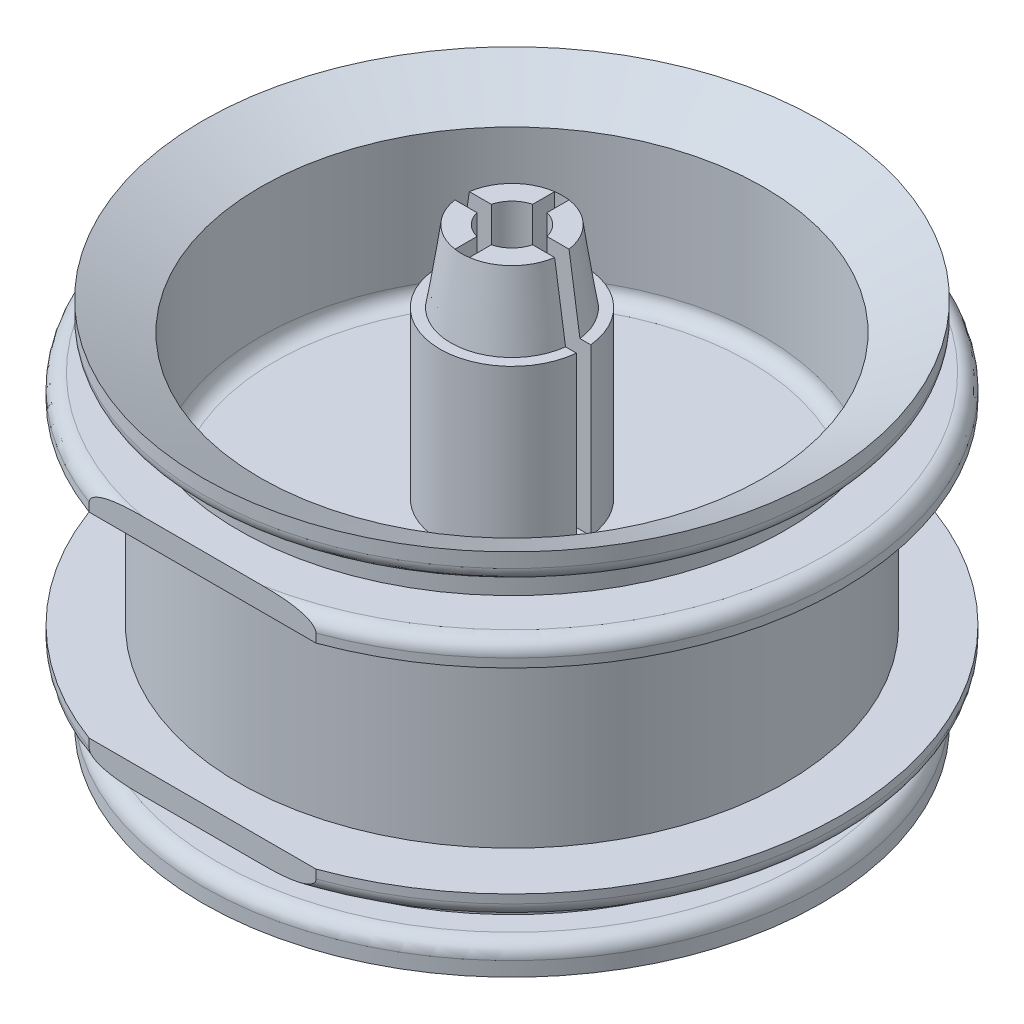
ISO-10303-21;
HEADER;
FILE_DESCRIPTION(('STEP AP214'),'2;1');
FILE_NAME('part.step','',(''),(''),'','','');
FILE_SCHEMA(('AUTOMOTIVE_DESIGN { 1 0 10303 214 1 1 1 1 }'));
ENDSEC;
DATA;
#1=APPLICATION_CONTEXT('core data for automotive mechanical design processes');
#2=APPLICATION_PROTOCOL_DEFINITION('international standard','automotive_design',2000,#1);
#3=PRODUCT_CONTEXT('',#1,'mechanical');
#4=PRODUCT('Part','Part','',(#3));
#5=PRODUCT_RELATED_PRODUCT_CATEGORY('part','',(#4));
#6=PRODUCT_DEFINITION_FORMATION('','',#4);
#7=PRODUCT_DEFINITION_CONTEXT('part definition',#1,'design');
#8=PRODUCT_DEFINITION('design','',#6,#7);
#9=PRODUCT_DEFINITION_SHAPE('','',#8);
#10=(LENGTH_UNIT() NAMED_UNIT(*) SI_UNIT(.MILLI.,.METRE.));
#11=(NAMED_UNIT(*) PLANE_ANGLE_UNIT() SI_UNIT($,.RADIAN.));
#12=(NAMED_UNIT(*) SI_UNIT($,.STERADIAN.) SOLID_ANGLE_UNIT());
#13=UNCERTAINTY_MEASURE_WITH_UNIT(LENGTH_MEASURE(1.E-05),#10,'distance_accuracy_value','');
#14=(GEOMETRIC_REPRESENTATION_CONTEXT(3) GLOBAL_UNCERTAINTY_ASSIGNED_CONTEXT((#13)) GLOBAL_UNIT_ASSIGNED_CONTEXT((#10,
#11,#12)) REPRESENTATION_CONTEXT('',''));
#15=CARTESIAN_POINT('',(0.,0.,0.));
#16=DIRECTION('',(0.,0.,1.));
#17=DIRECTION('',(1.,0.,0.));
#18=AXIS2_PLACEMENT_3D('',#15,#16,#17);
#19=CARTESIAN_POINT('',(-1.25,30.101,-1.5612494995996));
#20=DIRECTION('',(-1.,0.,0.));
#21=DIRECTION('',(0.,0.,1.));
#22=AXIS2_PLACEMENT_3D('',#19,#20,#21);
#23=PLANE('',#22);
#24=DIRECTION('',(0.,0.,1.));
#25=VECTOR('',#24,1.);
#26=CARTESIAN_POINT('',(-1.25,10.5,-1.5612494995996));
#27=LINE('',#26,#25);
#28=CARTESIAN_POINT('',(-1.25,10.5,-1.5612494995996));
#29=VERTEX_POINT('',#28);
#30=CARTESIAN_POINT('',(-1.25,10.5,1.5612494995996));
#31=VERTEX_POINT('',#30);
#32=EDGE_CURVE('E301',#29,#31,#27,.T.);
#33=ORIENTED_EDGE('',*,*,#32,.F.);
#34=DIRECTION('',(0.,-1.,0.));
#35=VECTOR('',#34,1.);
#36=CARTESIAN_POINT('',(-1.25,30.101,-1.5612494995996));
#37=LINE('',#36,#35);
#38=CARTESIAN_POINT('',(-1.25,13.,-1.5612494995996));
#39=VERTEX_POINT('',#38);
#40=EDGE_CURVE('E283',#39,#29,#37,.T.);
#41=ORIENTED_EDGE('',*,*,#40,.F.);
#42=DIRECTION('',(0.,0.,1.));
#43=VECTOR('',#42,1.);
#44=CARTESIAN_POINT('',(-1.25,13.,-1.5612494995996));
#45=LINE('',#44,#43);
#46=CARTESIAN_POINT('',(-1.25,13.,1.5612494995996));
#47=VERTEX_POINT('',#46);
#48=EDGE_CURVE('E298',#39,#47,#45,.T.);
#49=ORIENTED_EDGE('',*,*,#48,.T.);
#50=DIRECTION('',(0.,-1.,0.));
#51=VECTOR('',#50,1.);
#52=CARTESIAN_POINT('',(-1.25,30.101,1.5612494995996));
#53=LINE('',#52,#51);
#54=EDGE_CURVE('E598',#47,#31,#53,.T.);
#55=ORIENTED_EDGE('',*,*,#54,.T.);
#56=EDGE_LOOP('',(#33,#41,#49,#55));
#57=FACE_BOUND('',#56,.T.);
#58=ADVANCED_FACE('F39',(#57),#23,.F.);
#59=CARTESIAN_POINT('',(1.25,30.101,-1.5612494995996));
#60=DIRECTION('',(1.,0.,0.));
#61=DIRECTION('',(0.,0.,-1.));
#62=AXIS2_PLACEMENT_3D('',#59,#60,#61);
#63=PLANE('',#62);
#64=DIRECTION('',(0.,0.,-1.));
#65=VECTOR('',#64,1.);
#66=CARTESIAN_POINT('',(1.25,10.5,-1.5612494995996));
#67=LINE('',#66,#65);
#68=CARTESIAN_POINT('',(1.25,10.5,1.5612494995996));
#69=VERTEX_POINT('',#68);
#70=CARTESIAN_POINT('',(1.25,10.5,-1.5612494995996));
#71=VERTEX_POINT('',#70);
#72=EDGE_CURVE('E284',#69,#71,#67,.T.);
#73=ORIENTED_EDGE('',*,*,#72,.F.);
#74=DIRECTION('',(0.,-1.,0.));
#75=VECTOR('',#74,1.);
#76=CARTESIAN_POINT('',(1.25,30.101,1.5612494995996));
#77=LINE('',#76,#75);
#78=CARTESIAN_POINT('',(1.25,13.,1.5612494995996));
#79=VERTEX_POINT('',#78);
#80=EDGE_CURVE('E297',#79,#69,#77,.T.);
#81=ORIENTED_EDGE('',*,*,#80,.F.);
#82=DIRECTION('',(0.,0.,-1.));
#83=VECTOR('',#82,1.);
#84=CARTESIAN_POINT('',(1.25,13.,-1.5612494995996));
#85=LINE('',#84,#83);
#86=CARTESIAN_POINT('',(1.25,13.,-1.5612494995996));
#87=VERTEX_POINT('',#86);
#88=EDGE_CURVE('E295',#79,#87,#85,.T.);
#89=ORIENTED_EDGE('',*,*,#88,.T.);
#90=DIRECTION('',(0.,-1.,0.));
#91=VECTOR('',#90,1.);
#92=CARTESIAN_POINT('',(1.25,30.101,-1.5612494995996));
#93=LINE('',#92,#91);
#94=EDGE_CURVE('E280',#87,#71,#93,.T.);
#95=ORIENTED_EDGE('',*,*,#94,.T.);
#96=EDGE_LOOP('',(#73,#81,#89,#95));
#97=FACE_BOUND('',#96,.T.);
#98=ADVANCED_FACE('F293',(#97),#63,.F.);
#99=CARTESIAN_POINT('',(0.,20.2,0.));
#100=DIRECTION('',(0.,-1.,0.));
#101=DIRECTION('',(0.,0.,-1.));
#102=AXIS2_PLACEMENT_3D('',#99,#100,#101);
#103=TOROIDAL_SURFACE('',#102,21.9,1.);
#104=CARTESIAN_POINT('',(0.,21.1165151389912,-21.5));
#105=CARTESIAN_POINT('',(-0.166621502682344,21.1165124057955,-21.5));
#106=CARTESIAN_POINT('',(-0.333242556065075,21.1173672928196,-21.5));
#107=CARTESIAN_POINT('',(-0.666468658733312,21.1206904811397,-21.5));
#108=CARTESIAN_POINT('',(-0.833073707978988,21.1231587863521,-21.5));
#109=CARTESIAN_POINT('',(-1.16642143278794,21.12945613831,-21.5));
#110=CARTESIAN_POINT('',(-1.33316408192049,21.1332865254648,-21.5));
#111=CARTESIAN_POINT('',(-1.66660700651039,21.141891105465,-21.5));
#112=CARTESIAN_POINT('',(-1.8333072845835,21.1466651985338,-21.5));
#113=CARTESIAN_POINT('',(-2.33397789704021,21.1616444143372,-21.5));
#114=CARTESIAN_POINT('',(-2.66792543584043,21.1724917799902,-21.5));
#115=CARTESIAN_POINT('',(-3.33615321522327,21.190522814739,-21.5));
#116=CARTESIAN_POINT('',(-3.67043353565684,21.1977043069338,-21.5));
#117=CARTESIAN_POINT('',(-4.17169411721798,21.2004623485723,-21.5));
#118=CARTESIAN_POINT('',(-4.33864163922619,21.2000489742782,-21.5));
#119=CARTESIAN_POINT('',(-4.67247970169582,21.1954539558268,-21.5));
#120=CARTESIAN_POINT('',(-4.83937024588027,21.1912726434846,-21.5));
#121=CARTESIAN_POINT('',(-5.17277103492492,21.1778229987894,-21.5));
#122=CARTESIAN_POINT('',(-5.33928149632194,21.1685603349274,-21.5));
#123=CARTESIAN_POINT('',(-5.67176917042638,21.1432281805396,-21.5));
#124=CARTESIAN_POINT('',(-5.83774654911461,21.1271610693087,-21.5));
#125=CARTESIAN_POINT('',(-6.08627488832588,21.09600783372,-21.5));
#126=CARTESIAN_POINT('',(-6.16926272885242,21.0844080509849,-21.5));
#127=CARTESIAN_POINT('',(-6.33482300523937,21.0583850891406,-21.5));
#128=CARTESIAN_POINT('',(-6.41739533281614,21.0439612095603,-21.5));
#129=CARTESIAN_POINT('',(-6.5816357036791,21.0117554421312,-21.5));
#130=CARTESIAN_POINT('',(-6.66330571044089,20.9939837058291,-21.5));
#131=CARTESIAN_POINT('',(-6.82560586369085,20.954262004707,-21.5));
#132=CARTESIAN_POINT('',(-6.90623644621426,20.9323138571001,-21.5));
#133=CARTESIAN_POINT('',(-7.05411325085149,20.8866909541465,-21.5));
#134=CARTESIAN_POINT('',(-7.12158092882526,20.8637472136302,-21.5));
#135=CARTESIAN_POINT('',(-7.25490706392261,20.8127688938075,-21.5));
#136=CARTESIAN_POINT('',(-7.3207576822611,20.7847135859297,-21.5));
#137=CARTESIAN_POINT('',(-7.45020928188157,20.7214301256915,-21.5));
#138=CARTESIAN_POINT('',(-7.51376806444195,20.6861105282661,-21.5));
#139=CARTESIAN_POINT('',(-7.60403556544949,20.625869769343,-21.5));
#140=CARTESIAN_POINT('',(-7.63320021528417,20.6046531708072,-21.5));
#141=CARTESIAN_POINT('',(-7.68909839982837,20.5592595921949,-21.5));
#142=CARTESIAN_POINT('',(-7.71583687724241,20.5350888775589,-21.5));
#143=CARTESIAN_POINT('',(-7.75771374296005,20.4914422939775,-21.5));
#144=CARTESIAN_POINT('',(-7.77383672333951,20.4729183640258,-21.5));
#145=CARTESIAN_POINT('',(-7.80375716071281,20.4340265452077,-21.5));
#146=CARTESIAN_POINT('',(-7.81755315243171,20.4136575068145,-21.5));
#147=CARTESIAN_POINT('',(-7.84210344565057,20.3707940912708,-21.5));
#148=CARTESIAN_POINT('',(-7.85281952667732,20.3482772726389,-21.5));
#149=CARTESIAN_POINT('',(-7.86990834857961,20.3016524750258,-21.5));
#150=CARTESIAN_POINT('',(-7.87629044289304,20.2775480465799,-21.5));
#151=CARTESIAN_POINT('',(-7.88358376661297,20.2302793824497,-21.5));
#152=CARTESIAN_POINT('',(-7.8848551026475,20.2071720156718,-21.5));
#153=CARTESIAN_POINT('',(-7.88273976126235,20.1611700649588,-21.5));
#154=CARTESIAN_POINT('',(-7.8793521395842,20.1382755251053,-21.5));
#155=CARTESIAN_POINT('',(-7.86919429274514,20.0968499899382,-21.5));
#156=CARTESIAN_POINT('',(-7.86299536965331,20.0781727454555,-21.5));
#157=CARTESIAN_POINT('',(-7.84804781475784,20.0418839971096,-21.5));
#158=CARTESIAN_POINT('',(-7.83929866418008,20.0242727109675,-21.5));
#159=CARTESIAN_POINT('',(-7.81287429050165,19.9782364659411,-21.5));
#160=CARTESIAN_POINT('',(-7.79325299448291,19.9509339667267,-21.5));
#161=CARTESIAN_POINT('',(-7.75011512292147,19.8995925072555,-21.5));
#162=CARTESIAN_POINT('',(-7.7265853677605,19.8755651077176,-21.5));
#163=CARTESIAN_POINT('',(-7.67826191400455,19.8315288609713,-21.5));
#164=CARTESIAN_POINT('',(-7.65359703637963,19.8113762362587,-21.5));
#165=CARTESIAN_POINT('',(-7.60264474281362,19.7732207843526,-21.5));
#166=CARTESIAN_POINT('',(-7.57635579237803,19.7552200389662,-21.5));
#167=CARTESIAN_POINT('',(-7.4956924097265,19.703884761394,-21.5));
#168=CARTESIAN_POINT('',(-7.4395886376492,19.6732738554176,-21.5));
#169=CARTESIAN_POINT('',(-7.33801853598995,19.6238083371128,-21.5));
#170=CARTESIAN_POINT('',(-7.29305620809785,19.6038664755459,-21.5));
#171=CARTESIAN_POINT('',(-7.2020602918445,19.5665766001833,-21.5));
#172=CARTESIAN_POINT('',(-7.15602652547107,19.5492290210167,-21.5));
#173=CARTESIAN_POINT('',(-7.01663627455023,19.5003383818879,-21.5));
#174=CARTESIAN_POINT('',(-6.92215388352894,19.4720220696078,-21.5));
#175=CARTESIAN_POINT('',(-6.7311239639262,19.4215407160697,-21.5));
#176=CARTESIAN_POINT('',(-6.63456849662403,19.3994069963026,-21.5));
#177=CARTESIAN_POINT('',(-6.44060037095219,19.3600617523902,-21.5));
#178=CARTESIAN_POINT('',(-6.34318893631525,19.3428441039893,-21.5));
#179=CARTESIAN_POINT('',(-6.14000416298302,19.3110917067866,-21.5));
#180=CARTESIAN_POINT('',(-6.03418149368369,19.2968788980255,-21.5));
#181=CARTESIAN_POINT('',(-5.82210306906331,19.272110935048,-21.5));
#182=CARTESIAN_POINT('',(-5.71584725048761,19.2615563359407,-21.5));
#183=CARTESIAN_POINT('',(-5.39657335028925,19.2343434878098,-21.5));
#184=CARTESIAN_POINT('',(-5.18317723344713,19.2221544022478,-21.5));
#185=CARTESIAN_POINT('',(-4.75550980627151,19.2058695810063,-21.5));
#186=CARTESIAN_POINT('',(-4.54123776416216,19.2017976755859,-21.5));
#187=CARTESIAN_POINT('',(-4.11274563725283,19.1991693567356,-21.5));
#188=CARTESIAN_POINT('',(-3.89852555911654,19.2006110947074,-21.5));
#189=CARTESIAN_POINT('',(-3.47001257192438,19.2069048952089,-21.5));
#190=CARTESIAN_POINT('',(-3.25571970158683,19.2117590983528,-21.5));
#191=CARTESIAN_POINT('',(-2.82716432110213,19.2231189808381,-21.5));
#192=CARTESIAN_POINT('',(-2.61290181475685,19.2296247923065,-21.5));
#193=CARTESIAN_POINT('',(-2.18469958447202,19.2427574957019,-21.5));
#194=CARTESIAN_POINT('',(-1.97075985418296,19.2493841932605,-21.5));
#195=CARTESIAN_POINT('',(-1.54285413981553,19.2614989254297,-21.5));
#196=CARTESIAN_POINT('',(-1.32888815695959,19.266987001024,-21.5));
#197=CARTESIAN_POINT('',(-0.849012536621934,19.2769103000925,-21.5));
#198=CARTESIAN_POINT('',(-0.583089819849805,19.2807674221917,-21.5));
#199=CARTESIAN_POINT('',(-0.0511321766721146,19.2841682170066,-21.5));
#200=CARTESIAN_POINT('',(0.214902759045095,19.2837105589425,-21.5));
#201=CARTESIAN_POINT('',(0.746877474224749,19.2786028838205,-21.5));
#202=CARTESIAN_POINT('',(1.01281726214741,19.2739536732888,-21.5));
#203=CARTESIAN_POINT('',(1.5445975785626,19.2616964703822,-21.5));
#204=CARTESIAN_POINT('',(1.81043811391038,19.2540887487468,-21.5));
#205=CARTESIAN_POINT('',(2.34227826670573,19.2380144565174,-21.5));
#206=CARTESIAN_POINT('',(2.6082778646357,19.2295472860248,-21.5));
#207=CARTESIAN_POINT('',(3.14038324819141,19.2145003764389,-21.5));
#208=CARTESIAN_POINT('',(3.40648904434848,19.207920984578,-21.5));
#209=CARTESIAN_POINT('',(3.93851000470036,19.1999441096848,-21.5));
#210=CARTESIAN_POINT('',(4.20442504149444,19.1985407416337,-21.5));
#211=CARTESIAN_POINT('',(4.60317534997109,19.2034148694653,-21.5));
#212=CARTESIAN_POINT('',(4.73604849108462,19.2062016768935,-21.5));
#213=CARTESIAN_POINT('',(5.00169468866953,19.214761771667,-21.5));
#214=CARTESIAN_POINT('',(5.13446775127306,19.2205348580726,-21.5));
#215=CARTESIAN_POINT('',(5.4002294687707,19.2358763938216,-21.5));
#216=CARTESIAN_POINT('',(5.53321745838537,19.2454569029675,-21.5));
#217=CARTESIAN_POINT('',(5.7988293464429,19.2694458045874,-21.5));
#218=CARTESIAN_POINT('',(5.93145304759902,19.2838564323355,-21.5));
#219=CARTESIAN_POINT('',(6.19646004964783,19.3189649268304,-21.5));
#220=CARTESIAN_POINT('',(6.3288401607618,19.3396882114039,-21.5));
#221=CARTESIAN_POINT('',(6.52616248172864,19.3770596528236,-21.5));
#222=CARTESIAN_POINT('',(6.59170187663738,19.3905577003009,-21.5));
#223=CARTESIAN_POINT('',(6.7222148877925,19.4200401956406,-21.5));
#224=CARTESIAN_POINT('',(6.78718859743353,19.4360242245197,-21.5));
#225=CARTESIAN_POINT('',(6.91704977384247,19.4711700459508,-21.5));
#226=CARTESIAN_POINT('',(6.98192837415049,19.4903649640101,-21.5));
#227=CARTESIAN_POINT('',(7.11055184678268,19.5325503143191,-21.5));
#228=CARTESIAN_POINT('',(7.17429524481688,19.5555453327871,-21.5));
#229=CARTESIAN_POINT('',(7.29932994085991,19.6061466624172,-21.5));
#230=CARTESIAN_POINT('',(7.36063725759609,19.6337129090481,-21.5));
#231=CARTESIAN_POINT('',(7.47998812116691,19.6950900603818,-21.5));
#232=CARTESIAN_POINT('',(7.53804041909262,19.7288830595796,-21.5));
#233=CARTESIAN_POINT('',(7.62440392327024,19.7887860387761,-21.5));
#234=CARTESIAN_POINT('',(7.6547522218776,19.8119326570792,-21.5));
#235=CARTESIAN_POINT('',(7.71246442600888,19.8617572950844,-21.5));
#236=CARTESIAN_POINT('',(7.7398307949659,19.8884323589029,-21.5));
#237=CARTESIAN_POINT('',(7.78247568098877,19.9375720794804,-21.5));
#238=CARTESIAN_POINT('',(7.79894911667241,19.9589877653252,-21.5));
#239=CARTESIAN_POINT('',(7.82848994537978,20.0040701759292,-21.5));
#240=CARTESIAN_POINT('',(7.84156328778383,20.0277328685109,-21.5));
#241=CARTESIAN_POINT('',(7.86056836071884,20.0714315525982,-21.5));
#242=CARTESIAN_POINT('',(7.86745121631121,20.0910490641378,-21.5));
#243=CARTESIAN_POINT('',(7.87785699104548,20.1311555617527,-21.5));
#244=CARTESIAN_POINT('',(7.88138385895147,20.1516434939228,-21.5));
#245=CARTESIAN_POINT('',(7.88471438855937,20.1930158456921,-21.5));
#246=CARTESIAN_POINT('',(7.8845022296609,20.21390157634,-21.5));
#247=CARTESIAN_POINT('',(7.88034183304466,20.2552985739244,-21.5));
#248=CARTESIAN_POINT('',(7.87639109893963,20.2758095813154,-21.5));
#249=CARTESIAN_POINT('',(7.86422730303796,20.3192389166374,-21.5));
#250=CARTESIAN_POINT('',(7.85541177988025,20.3419859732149,-21.5));
#251=CARTESIAN_POINT('',(7.83421424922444,20.3857446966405,-21.5));
#252=CARTESIAN_POINT('',(7.82182564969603,20.4067530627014,-21.5));
#253=CARTESIAN_POINT('',(7.7866404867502,20.4583272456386,-21.5));
#254=CARTESIAN_POINT('',(7.76192307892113,20.4875673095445,-21.5));
#255=CARTESIAN_POINT('',(7.70849862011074,20.5421033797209,-21.5));
#256=CARTESIAN_POINT('',(7.67978112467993,20.5673886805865,-21.5));
#257=CARTESIAN_POINT('',(7.61949498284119,20.6149483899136,-21.5));
#258=CARTESIAN_POINT('',(7.58789927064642,20.6371879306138,-21.5));
#259=CARTESIAN_POINT('',(7.52295479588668,20.6789708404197,-21.5));
#260=CARTESIAN_POINT('',(7.48960421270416,20.698511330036,-21.5));
#261=CARTESIAN_POINT('',(7.42161973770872,20.7353956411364,-21.5));
#262=CARTESIAN_POINT('',(7.38698299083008,20.7527341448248,-21.5));
#263=CARTESIAN_POINT('',(7.31685290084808,20.7855154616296,-21.5));
#264=CARTESIAN_POINT('',(7.28135997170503,20.8009591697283,-21.5));
#265=CARTESIAN_POINT('',(7.18652087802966,20.8397351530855,-21.5));
#266=CARTESIAN_POINT('',(7.12661543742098,20.8616976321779,-21.5));
#267=CARTESIAN_POINT('',(7.00564743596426,20.9022022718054,-21.5));
#268=CARTESIAN_POINT('',(6.944584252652,20.9207425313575,-21.5));
#269=CARTESIAN_POINT('',(6.82156945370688,20.9550500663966,-21.5));
#270=CARTESIAN_POINT('',(6.75961641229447,20.9708121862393,-21.5));
#271=CARTESIAN_POINT('',(6.63515497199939,20.9999832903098,-21.5));
#272=CARTESIAN_POINT('',(6.57264648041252,21.0133918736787,-21.5));
#273=CARTESIAN_POINT('',(6.38403346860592,21.0507284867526,-21.5));
#274=CARTESIAN_POINT('',(6.25733049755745,21.0716378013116,-21.5));
#275=CARTESIAN_POINT('',(6.0032569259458,21.1074092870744,-21.5));
#276=CARTESIAN_POINT('',(5.87588721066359,21.1222780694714,-21.5));
#277=CARTESIAN_POINT('',(5.62913050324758,21.1464931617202,-21.5));
#278=CARTESIAN_POINT('',(5.50977230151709,21.1561395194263,-21.5));
#279=CARTESIAN_POINT('',(5.27083122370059,21.1721323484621,-21.5));
#280=CARTESIAN_POINT('',(5.1512483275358,21.1784785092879,-21.5));
#281=CARTESIAN_POINT('',(4.79219424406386,21.193541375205,-21.5));
#282=CARTESIAN_POINT('',(4.55255920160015,21.1982702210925,-21.5));
#283=CARTESIAN_POINT('',(4.07391232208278,21.200924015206,-21.5));
#284=CARTESIAN_POINT('',(3.83490046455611,21.1988664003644,-21.5));
#285=CARTESIAN_POINT('',(3.35701564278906,21.1908342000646,-21.5));
#286=CARTESIAN_POINT('',(3.11814265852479,21.1848606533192,-21.5));
#287=CARTESIAN_POINT('',(2.63937355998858,21.1713419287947,-21.5));
#288=CARTESIAN_POINT('',(2.39947766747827,21.1637898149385,-21.5));
#289=CARTESIAN_POINT('',(1.91965584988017,21.1491607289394,-21.5));
#290=CARTESIAN_POINT('',(1.67972992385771,21.1420837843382,-21.5));
#291=CARTESIAN_POINT('',(1.19985627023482,21.1300331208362,-21.5));
#292=CARTESIAN_POINT('',(0.959908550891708,21.1250590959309,-21.5));
#293=CARTESIAN_POINT('',(0.479973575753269,21.1183021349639,-21.5));
#294=CARTESIAN_POINT('',(0.239986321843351,21.1165190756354,-21.5));
#295=CARTESIAN_POINT('',(0.,21.1165151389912,-21.5));
#296=B_SPLINE_CURVE_WITH_KNOTS('',3,(#104,#105,#106,#107,#108,#109,#110,#111,#112,#113,#114,
#115,#116,#117,#118,#119,#120,#121,#122,#123,#124,#125,#126,#127,#128,#129,#130,#131,#132,#133,
#134,#135,#136,#137,#138,#139,#140,#141,#142,#143,#144,#145,#146,#147,#148,#149,#150,#151,#152,
#153,#154,#155,#156,#157,#158,#159,#160,#161,#162,#163,#164,#165,#166,#167,#168,#169,#170,#171,
#172,#173,#174,#175,#176,#177,#178,#179,#180,#181,#182,#183,#184,#185,#186,#187,#188,#189,#190,
#191,#192,#193,#194,#195,#196,#197,#198,#199,#200,#201,#202,#203,#204,#205,#206,#207,#208,#209,
#210,#211,#212,#213,#214,#215,#216,#217,#218,#219,#220,#221,#222,#223,#224,#225,#226,#227,#228,
#229,#230,#231,#232,#233,#234,#235,#236,#237,#238,#239,#240,#241,#242,#243,#244,#245,#246,#247,
#248,#249,#250,#251,#252,#253,#254,#255,#256,#257,#258,#259,#260,#261,#262,#263,#264,#265,#266,
#267,#268,#269,#270,#271,#272,#273,#274,#275,#276,#277,#278,#279,#280,#281,#282,#283,#284,#285,
#286,#287,#288,#289,#290,#291,#292,#293,#294,#295),.UNSPECIFIED.,.T.,.F.,(4,2,2,2,2,2,2,2,2,2,2,
2,2,2,2,2,2,2,2,2,2,2,2,2,2,2,2,2,2,2,2,2,2,2,2,2,2,2,2,2,2,2,2,2,2,2,2,2,2,2,2,2,2,2,2,2,2,2,2,
2,2,2,2,2,2,2,2,2,2,2,2,2,2,2,2,2,2,2,2,2,2,2,2,2,2,2,2,2,2,2,2,2,2,2,2,4),(0.,
0.499861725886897,0.999724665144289,1.50008088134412,2.0003842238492,3.00276910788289,
4.00574854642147,4.50656230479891,5.00733196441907,5.50754412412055,6.00758152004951,
6.25892789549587,6.51033669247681,6.7609950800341,7.01154465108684,7.22517389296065,
7.43968955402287,7.65709197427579,7.7651513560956,7.8729854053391,7.94652155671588,
8.02010384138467,8.09456329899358,8.16886154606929,8.23782192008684,8.30679627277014,
8.3656179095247,8.42445152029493,8.52473279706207,8.62535936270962,8.72076769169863,
8.81626758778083,9.00752860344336,9.15501832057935,9.30253271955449,9.59809704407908,
9.89513263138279,10.1917965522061,10.5120359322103,10.8323238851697,11.4732882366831,
12.1161315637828,12.7587593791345,13.4017906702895,14.0448734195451,14.6870001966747,
15.3291038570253,16.1269265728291,16.9249953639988,17.722910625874,18.5207528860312,
19.3191559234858,20.1177057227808,20.9153473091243,21.3140285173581,21.7126829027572,
22.1126101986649,22.5127228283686,22.9144682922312,23.1151757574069,23.3158494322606,
23.5187379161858,23.7218730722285,23.9233137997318,24.1241840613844,24.2385043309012,
24.3527294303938,24.4335607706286,24.5142497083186,24.5763705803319,24.6384182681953,
24.7007285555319,24.7630804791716,24.8358628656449,24.9087803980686,25.0229954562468,
25.137514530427,25.253251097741,25.3691102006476,25.4852439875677,25.6013227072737,
25.7925889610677,25.9839611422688,26.1756848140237,26.3674411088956,26.7524684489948,
27.1370732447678,27.4962581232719,27.8554767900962,28.5743398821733,29.2913573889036,
30.0081847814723,30.7282306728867,31.4483182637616,32.1683010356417,32.8882559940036),.UNSPECIFIED.);
#297=CARTESIAN_POINT('',(7.88416133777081,20.2,-21.5));
#298=VERTEX_POINT('',#297);
#299=CARTESIAN_POINT('',(4.1665333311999,21.2,-21.5));
#300=VERTEX_POINT('',#299);
#301=EDGE_CURVE('E313',#298,#300,#296,.T.);
#302=ORIENTED_EDGE('',*,*,#301,.T.);
#303=CARTESIAN_POINT('',(0.,21.2,0.));
#304=DIRECTION('',(0.,-1.,0.));
#305=DIRECTION('',(0.,0.,-1.));
#306=AXIS2_PLACEMENT_3D('',#303,#304,#305);
#307=CIRCLE('',#306,21.9);
#308=CARTESIAN_POINT('',(4.1665333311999,21.2,21.5));
#309=VERTEX_POINT('',#308);
#310=EDGE_CURVE('E568',#300,#309,#307,.T.);
#311=ORIENTED_EDGE('',*,*,#310,.T.);
#312=CARTESIAN_POINT('',(0.,21.1165151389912,21.5));
#313=CARTESIAN_POINT('',(-0.166621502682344,21.1165124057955,21.5));
#314=CARTESIAN_POINT('',(-0.333242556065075,21.1173672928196,21.5));
#315=CARTESIAN_POINT('',(-0.666468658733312,21.1206904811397,21.5));
#316=CARTESIAN_POINT('',(-0.833073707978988,21.1231587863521,21.5));
#317=CARTESIAN_POINT('',(-1.16642143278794,21.12945613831,21.5));
#318=CARTESIAN_POINT('',(-1.33316408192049,21.1332865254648,21.5));
#319=CARTESIAN_POINT('',(-1.66660700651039,21.141891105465,21.5));
#320=CARTESIAN_POINT('',(-1.8333072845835,21.1466651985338,21.5));
#321=CARTESIAN_POINT('',(-2.33397789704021,21.1616444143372,21.5));
#322=CARTESIAN_POINT('',(-2.66792543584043,21.1724917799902,21.5));
#323=CARTESIAN_POINT('',(-3.33615321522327,21.190522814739,21.5));
#324=CARTESIAN_POINT('',(-3.67043353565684,21.1977043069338,21.5));
#325=CARTESIAN_POINT('',(-4.17169411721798,21.2004623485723,21.5));
#326=CARTESIAN_POINT('',(-4.33864163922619,21.2000489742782,21.5));
#327=CARTESIAN_POINT('',(-4.67247970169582,21.1954539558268,21.5));
#328=CARTESIAN_POINT('',(-4.83937024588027,21.1912726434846,21.5));
#329=CARTESIAN_POINT('',(-5.17277103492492,21.1778229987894,21.5));
#330=CARTESIAN_POINT('',(-5.33928149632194,21.1685603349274,21.5));
#331=CARTESIAN_POINT('',(-5.67176917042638,21.1432281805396,21.5));
#332=CARTESIAN_POINT('',(-5.83774654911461,21.1271610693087,21.5));
#333=CARTESIAN_POINT('',(-6.08627488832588,21.09600783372,21.5));
#334=CARTESIAN_POINT('',(-6.16926272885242,21.0844080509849,21.5));
#335=CARTESIAN_POINT('',(-6.33482300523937,21.0583850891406,21.5));
#336=CARTESIAN_POINT('',(-6.41739533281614,21.0439612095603,21.5));
#337=CARTESIAN_POINT('',(-6.5816357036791,21.0117554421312,21.5));
#338=CARTESIAN_POINT('',(-6.66330571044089,20.9939837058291,21.5));
#339=CARTESIAN_POINT('',(-6.82560586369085,20.954262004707,21.5));
#340=CARTESIAN_POINT('',(-6.90623644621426,20.9323138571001,21.5));
#341=CARTESIAN_POINT('',(-7.05411325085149,20.8866909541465,21.5));
#342=CARTESIAN_POINT('',(-7.12158092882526,20.8637472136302,21.5));
#343=CARTESIAN_POINT('',(-7.25490706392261,20.8127688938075,21.5));
#344=CARTESIAN_POINT('',(-7.3207576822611,20.7847135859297,21.5));
#345=CARTESIAN_POINT('',(-7.45020928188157,20.7214301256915,21.5));
#346=CARTESIAN_POINT('',(-7.51376806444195,20.6861105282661,21.5));
#347=CARTESIAN_POINT('',(-7.60403556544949,20.625869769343,21.5));
#348=CARTESIAN_POINT('',(-7.63320021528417,20.6046531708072,21.5));
#349=CARTESIAN_POINT('',(-7.68909839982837,20.5592595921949,21.5));
#350=CARTESIAN_POINT('',(-7.71583687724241,20.5350888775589,21.5));
#351=CARTESIAN_POINT('',(-7.75771374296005,20.4914422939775,21.5));
#352=CARTESIAN_POINT('',(-7.77383672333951,20.4729183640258,21.5));
#353=CARTESIAN_POINT('',(-7.80375716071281,20.4340265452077,21.5));
#354=CARTESIAN_POINT('',(-7.81755315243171,20.4136575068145,21.5));
#355=CARTESIAN_POINT('',(-7.84210344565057,20.3707940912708,21.5));
#356=CARTESIAN_POINT('',(-7.85281952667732,20.3482772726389,21.5));
#357=CARTESIAN_POINT('',(-7.86990834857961,20.3016524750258,21.5));
#358=CARTESIAN_POINT('',(-7.87629044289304,20.2775480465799,21.5));
#359=CARTESIAN_POINT('',(-7.88358376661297,20.2302793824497,21.5));
#360=CARTESIAN_POINT('',(-7.8848551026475,20.2071720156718,21.5));
#361=CARTESIAN_POINT('',(-7.88273976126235,20.1611700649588,21.5));
#362=CARTESIAN_POINT('',(-7.8793521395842,20.1382755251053,21.5));
#363=CARTESIAN_POINT('',(-7.86919429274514,20.0968499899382,21.5));
#364=CARTESIAN_POINT('',(-7.86299536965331,20.0781727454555,21.5));
#365=CARTESIAN_POINT('',(-7.84804781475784,20.0418839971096,21.5));
#366=CARTESIAN_POINT('',(-7.83929866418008,20.0242727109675,21.5));
#367=CARTESIAN_POINT('',(-7.81287429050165,19.9782364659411,21.5));
#368=CARTESIAN_POINT('',(-7.79325299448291,19.9509339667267,21.5));
#369=CARTESIAN_POINT('',(-7.75011512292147,19.8995925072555,21.5));
#370=CARTESIAN_POINT('',(-7.7265853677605,19.8755651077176,21.5));
#371=CARTESIAN_POINT('',(-7.67826191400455,19.8315288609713,21.5));
#372=CARTESIAN_POINT('',(-7.65359703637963,19.8113762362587,21.5));
#373=CARTESIAN_POINT('',(-7.60264474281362,19.7732207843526,21.5));
#374=CARTESIAN_POINT('',(-7.57635579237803,19.7552200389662,21.5));
#375=CARTESIAN_POINT('',(-7.4956924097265,19.703884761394,21.5));
#376=CARTESIAN_POINT('',(-7.4395886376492,19.6732738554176,21.5));
#377=CARTESIAN_POINT('',(-7.33801853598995,19.6238083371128,21.5));
#378=CARTESIAN_POINT('',(-7.29305620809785,19.6038664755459,21.5));
#379=CARTESIAN_POINT('',(-7.2020602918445,19.5665766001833,21.5));
#380=CARTESIAN_POINT('',(-7.15602652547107,19.5492290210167,21.5));
#381=CARTESIAN_POINT('',(-7.01663627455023,19.5003383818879,21.5));
#382=CARTESIAN_POINT('',(-6.92215388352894,19.4720220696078,21.5));
#383=CARTESIAN_POINT('',(-6.7311239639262,19.4215407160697,21.5));
#384=CARTESIAN_POINT('',(-6.63456849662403,19.3994069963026,21.5));
#385=CARTESIAN_POINT('',(-6.44060037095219,19.3600617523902,21.5));
#386=CARTESIAN_POINT('',(-6.34318893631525,19.3428441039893,21.5));
#387=CARTESIAN_POINT('',(-6.14000416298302,19.3110917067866,21.5));
#388=CARTESIAN_POINT('',(-6.03418149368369,19.2968788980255,21.5));
#389=CARTESIAN_POINT('',(-5.82210306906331,19.272110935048,21.5));
#390=CARTESIAN_POINT('',(-5.71584725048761,19.2615563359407,21.5));
#391=CARTESIAN_POINT('',(-5.39657335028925,19.2343434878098,21.5));
#392=CARTESIAN_POINT('',(-5.18317723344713,19.2221544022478,21.5));
#393=CARTESIAN_POINT('',(-4.75550980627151,19.2058695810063,21.5));
#394=CARTESIAN_POINT('',(-4.54123776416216,19.2017976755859,21.5));
#395=CARTESIAN_POINT('',(-4.11274563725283,19.1991693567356,21.5));
#396=CARTESIAN_POINT('',(-3.89852555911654,19.2006110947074,21.5));
#397=CARTESIAN_POINT('',(-3.47001257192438,19.2069048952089,21.5));
#398=CARTESIAN_POINT('',(-3.25571970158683,19.2117590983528,21.5));
#399=CARTESIAN_POINT('',(-2.82716432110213,19.2231189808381,21.5));
#400=CARTESIAN_POINT('',(-2.61290181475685,19.2296247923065,21.5));
#401=CARTESIAN_POINT('',(-2.18469958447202,19.2427574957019,21.5));
#402=CARTESIAN_POINT('',(-1.97075985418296,19.2493841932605,21.5));
#403=CARTESIAN_POINT('',(-1.54285413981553,19.2614989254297,21.5));
#404=CARTESIAN_POINT('',(-1.32888815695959,19.266987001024,21.5));
#405=CARTESIAN_POINT('',(-0.849012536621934,19.2769103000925,21.5));
#406=CARTESIAN_POINT('',(-0.583089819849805,19.2807674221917,21.5));
#407=CARTESIAN_POINT('',(-0.0511321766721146,19.2841682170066,21.5));
#408=CARTESIAN_POINT('',(0.214902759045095,19.2837105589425,21.5));
#409=CARTESIAN_POINT('',(0.746877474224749,19.2786028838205,21.5));
#410=CARTESIAN_POINT('',(1.01281726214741,19.2739536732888,21.5));
#411=CARTESIAN_POINT('',(1.5445975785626,19.2616964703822,21.5));
#412=CARTESIAN_POINT('',(1.81043811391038,19.2540887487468,21.5));
#413=CARTESIAN_POINT('',(2.34227826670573,19.2380144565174,21.5));
#414=CARTESIAN_POINT('',(2.6082778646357,19.2295472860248,21.5));
#415=CARTESIAN_POINT('',(3.14038324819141,19.2145003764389,21.5));
#416=CARTESIAN_POINT('',(3.40648904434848,19.207920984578,21.5));
#417=CARTESIAN_POINT('',(3.93851000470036,19.1999441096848,21.5));
#418=CARTESIAN_POINT('',(4.20442504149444,19.1985407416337,21.5));
#419=CARTESIAN_POINT('',(4.60317534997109,19.2034148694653,21.5));
#420=CARTESIAN_POINT('',(4.73604849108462,19.2062016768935,21.5));
#421=CARTESIAN_POINT('',(5.00169468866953,19.214761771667,21.5));
#422=CARTESIAN_POINT('',(5.13446775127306,19.2205348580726,21.5));
#423=CARTESIAN_POINT('',(5.4002294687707,19.2358763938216,21.5));
#424=CARTESIAN_POINT('',(5.53321745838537,19.2454569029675,21.5));
#425=CARTESIAN_POINT('',(5.7988293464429,19.2694458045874,21.5));
#426=CARTESIAN_POINT('',(5.93145304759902,19.2838564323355,21.5));
#427=CARTESIAN_POINT('',(6.19646004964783,19.3189649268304,21.5));
#428=CARTESIAN_POINT('',(6.3288401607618,19.3396882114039,21.5));
#429=CARTESIAN_POINT('',(6.52616248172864,19.3770596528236,21.5));
#430=CARTESIAN_POINT('',(6.59170187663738,19.3905577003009,21.5));
#431=CARTESIAN_POINT('',(6.7222148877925,19.4200401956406,21.5));
#432=CARTESIAN_POINT('',(6.78718859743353,19.4360242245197,21.5));
#433=CARTESIAN_POINT('',(6.91704977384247,19.4711700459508,21.5));
#434=CARTESIAN_POINT('',(6.98192837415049,19.4903649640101,21.5));
#435=CARTESIAN_POINT('',(7.11055184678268,19.5325503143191,21.5));
#436=CARTESIAN_POINT('',(7.17429524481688,19.5555453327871,21.5));
#437=CARTESIAN_POINT('',(7.29932994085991,19.6061466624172,21.5));
#438=CARTESIAN_POINT('',(7.36063725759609,19.6337129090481,21.5));
#439=CARTESIAN_POINT('',(7.47998812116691,19.6950900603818,21.5));
#440=CARTESIAN_POINT('',(7.53804041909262,19.7288830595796,21.5));
#441=CARTESIAN_POINT('',(7.62440392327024,19.7887860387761,21.5));
#442=CARTESIAN_POINT('',(7.6547522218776,19.8119326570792,21.5));
#443=CARTESIAN_POINT('',(7.71246442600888,19.8617572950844,21.5));
#444=CARTESIAN_POINT('',(7.7398307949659,19.8884323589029,21.5));
#445=CARTESIAN_POINT('',(7.78247568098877,19.9375720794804,21.5));
#446=CARTESIAN_POINT('',(7.79894911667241,19.9589877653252,21.5));
#447=CARTESIAN_POINT('',(7.82848994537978,20.0040701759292,21.5));
#448=CARTESIAN_POINT('',(7.84156328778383,20.0277328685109,21.5));
#449=CARTESIAN_POINT('',(7.86056836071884,20.0714315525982,21.5));
#450=CARTESIAN_POINT('',(7.86745121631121,20.0910490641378,21.5));
#451=CARTESIAN_POINT('',(7.87785699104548,20.1311555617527,21.5));
#452=CARTESIAN_POINT('',(7.88138385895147,20.1516434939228,21.5));
#453=CARTESIAN_POINT('',(7.88471438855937,20.1930158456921,21.5));
#454=CARTESIAN_POINT('',(7.8845022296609,20.21390157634,21.5));
#455=CARTESIAN_POINT('',(7.88034183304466,20.2552985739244,21.5));
#456=CARTESIAN_POINT('',(7.87639109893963,20.2758095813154,21.5));
#457=CARTESIAN_POINT('',(7.86422730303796,20.3192389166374,21.5));
#458=CARTESIAN_POINT('',(7.85541177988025,20.3419859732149,21.5));
#459=CARTESIAN_POINT('',(7.83421424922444,20.3857446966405,21.5));
#460=CARTESIAN_POINT('',(7.82182564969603,20.4067530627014,21.5));
#461=CARTESIAN_POINT('',(7.7866404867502,20.4583272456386,21.5));
#462=CARTESIAN_POINT('',(7.76192307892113,20.4875673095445,21.5));
#463=CARTESIAN_POINT('',(7.70849862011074,20.5421033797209,21.5));
#464=CARTESIAN_POINT('',(7.67978112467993,20.5673886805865,21.5));
#465=CARTESIAN_POINT('',(7.61949498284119,20.6149483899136,21.5));
#466=CARTESIAN_POINT('',(7.58789927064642,20.6371879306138,21.5));
#467=CARTESIAN_POINT('',(7.52295479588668,20.6789708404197,21.5));
#468=CARTESIAN_POINT('',(7.48960421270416,20.698511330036,21.5));
#469=CARTESIAN_POINT('',(7.42161973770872,20.7353956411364,21.5));
#470=CARTESIAN_POINT('',(7.38698299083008,20.7527341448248,21.5));
#471=CARTESIAN_POINT('',(7.31685290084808,20.7855154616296,21.5));
#472=CARTESIAN_POINT('',(7.28135997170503,20.8009591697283,21.5));
#473=CARTESIAN_POINT('',(7.18652087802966,20.8397351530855,21.5));
#474=CARTESIAN_POINT('',(7.12661543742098,20.8616976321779,21.5));
#475=CARTESIAN_POINT('',(7.00564743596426,20.9022022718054,21.5));
#476=CARTESIAN_POINT('',(6.944584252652,20.9207425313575,21.5));
#477=CARTESIAN_POINT('',(6.82156945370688,20.9550500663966,21.5));
#478=CARTESIAN_POINT('',(6.75961641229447,20.9708121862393,21.5));
#479=CARTESIAN_POINT('',(6.63515497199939,20.9999832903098,21.5));
#480=CARTESIAN_POINT('',(6.57264648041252,21.0133918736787,21.5));
#481=CARTESIAN_POINT('',(6.38403346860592,21.0507284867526,21.5));
#482=CARTESIAN_POINT('',(6.25733049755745,21.0716378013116,21.5));
#483=CARTESIAN_POINT('',(6.0032569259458,21.1074092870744,21.5));
#484=CARTESIAN_POINT('',(5.87588721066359,21.1222780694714,21.5));
#485=CARTESIAN_POINT('',(5.62913050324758,21.1464931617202,21.5));
#486=CARTESIAN_POINT('',(5.50977230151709,21.1561395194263,21.5));
#487=CARTESIAN_POINT('',(5.27083122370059,21.1721323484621,21.5));
#488=CARTESIAN_POINT('',(5.1512483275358,21.1784785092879,21.5));
#489=CARTESIAN_POINT('',(4.79219424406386,21.193541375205,21.5));
#490=CARTESIAN_POINT('',(4.55255920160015,21.1982702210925,21.5));
#491=CARTESIAN_POINT('',(4.07391232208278,21.200924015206,21.5));
#492=CARTESIAN_POINT('',(3.83490046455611,21.1988664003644,21.5));
#493=CARTESIAN_POINT('',(3.35701564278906,21.1908342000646,21.5));
#494=CARTESIAN_POINT('',(3.11814265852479,21.1848606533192,21.5));
#495=CARTESIAN_POINT('',(2.63937355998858,21.1713419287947,21.5));
#496=CARTESIAN_POINT('',(2.39947766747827,21.1637898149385,21.5));
#497=CARTESIAN_POINT('',(1.91965584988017,21.1491607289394,21.5));
#498=CARTESIAN_POINT('',(1.67972992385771,21.1420837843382,21.5));
#499=CARTESIAN_POINT('',(1.19985627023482,21.1300331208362,21.5));
#500=CARTESIAN_POINT('',(0.959908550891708,21.1250590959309,21.5));
#501=CARTESIAN_POINT('',(0.479973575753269,21.1183021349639,21.5));
#502=CARTESIAN_POINT('',(0.239986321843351,21.1165190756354,21.5));
#503=CARTESIAN_POINT('',(0.,21.1165151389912,21.5));
#504=B_SPLINE_CURVE_WITH_KNOTS('',3,(#312,#313,#314,#315,#316,#317,#318,#319,#320,#321,#322,
#323,#324,#325,#326,#327,#328,#329,#330,#331,#332,#333,#334,#335,#336,#337,#338,#339,#340,#341,
#342,#343,#344,#345,#346,#347,#348,#349,#350,#351,#352,#353,#354,#355,#356,#357,#358,#359,#360,
#361,#362,#363,#364,#365,#366,#367,#368,#369,#370,#371,#372,#373,#374,#375,#376,#377,#378,#379,
#380,#381,#382,#383,#384,#385,#386,#387,#388,#389,#390,#391,#392,#393,#394,#395,#396,#397,#398,
#399,#400,#401,#402,#403,#404,#405,#406,#407,#408,#409,#410,#411,#412,#413,#414,#415,#416,#417,
#418,#419,#420,#421,#422,#423,#424,#425,#426,#427,#428,#429,#430,#431,#432,#433,#434,#435,#436,
#437,#438,#439,#440,#441,#442,#443,#444,#445,#446,#447,#448,#449,#450,#451,#452,#453,#454,#455,
#456,#457,#458,#459,#460,#461,#462,#463,#464,#465,#466,#467,#468,#469,#470,#471,#472,#473,#474,
#475,#476,#477,#478,#479,#480,#481,#482,#483,#484,#485,#486,#487,#488,#489,#490,#491,#492,#493,
#494,#495,#496,#497,#498,#499,#500,#501,#502,#503),.UNSPECIFIED.,.T.,.F.,(4,2,2,2,2,2,2,2,2,2,2,
2,2,2,2,2,2,2,2,2,2,2,2,2,2,2,2,2,2,2,2,2,2,2,2,2,2,2,2,2,2,2,2,2,2,2,2,2,2,2,2,2,2,2,2,2,2,2,2,
2,2,2,2,2,2,2,2,2,2,2,2,2,2,2,2,2,2,2,2,2,2,2,2,2,2,2,2,2,2,2,2,2,2,2,2,4),(0.,
0.499861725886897,0.999724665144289,1.50008088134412,2.0003842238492,3.00276910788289,
4.00574854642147,4.50656230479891,5.00733196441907,5.50754412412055,6.00758152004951,
6.25892789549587,6.51033669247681,6.7609950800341,7.01154465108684,7.22517389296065,
7.43968955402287,7.65709197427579,7.7651513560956,7.8729854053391,7.94652155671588,
8.02010384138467,8.09456329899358,8.16886154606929,8.23782192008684,8.30679627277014,
8.3656179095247,8.42445152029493,8.52473279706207,8.62535936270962,8.72076769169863,
8.81626758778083,9.00752860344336,9.15501832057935,9.30253271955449,9.59809704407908,
9.89513263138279,10.1917965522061,10.5120359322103,10.8323238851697,11.4732882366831,
12.1161315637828,12.7587593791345,13.4017906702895,14.0448734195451,14.6870001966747,
15.3291038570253,16.1269265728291,16.9249953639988,17.722910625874,18.5207528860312,
19.3191559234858,20.1177057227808,20.9153473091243,21.3140285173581,21.7126829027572,
22.1126101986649,22.5127228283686,22.9144682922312,23.1151757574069,23.3158494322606,
23.5187379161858,23.7218730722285,23.9233137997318,24.1241840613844,24.2385043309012,
24.3527294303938,24.4335607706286,24.5142497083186,24.5763705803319,24.6384182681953,
24.7007285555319,24.7630804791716,24.8358628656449,24.9087803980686,25.0229954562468,
25.137514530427,25.253251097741,25.3691102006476,25.4852439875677,25.6013227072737,
25.7925889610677,25.9839611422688,26.1756848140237,26.3674411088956,26.7524684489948,
27.1370732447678,27.4962581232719,27.8554767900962,28.5743398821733,29.2913573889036,
30.0081847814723,30.7282306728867,31.4483182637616,32.1683010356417,32.8882559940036),.UNSPECIFIED.);
#505=CARTESIAN_POINT('',(7.88416133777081,20.2,21.5));
#506=VERTEX_POINT('',#505);
#507=EDGE_CURVE('E771',#506,#309,#504,.T.);
#508=ORIENTED_EDGE('',*,*,#507,.F.);
#509=CARTESIAN_POINT('',(0.,20.2,0.));
#510=DIRECTION('',(0.,-1.,0.));
#511=DIRECTION('',(0.,0.,-1.));
#512=AXIS2_PLACEMENT_3D('',#509,#510,#511);
#513=CIRCLE('',#512,22.9);
#514=EDGE_CURVE('E554',#298,#506,#513,.T.);
#515=ORIENTED_EDGE('',*,*,#514,.F.);
#516=EDGE_LOOP('',(#302,#311,#508,#515));
#517=FACE_BOUND('',#516,.T.);
#518=ADVANCED_FACE('F344',(#517),#103,.T.);
#519=CARTESIAN_POINT('',(0.,0.,0.));
#520=DIRECTION('',(0.,-1.,0.));
#521=DIRECTION('',(0.,0.,-1.));
#522=AXIS2_PLACEMENT_3D('',#519,#520,#521);
#523=CYLINDRICAL_SURFACE('',#522,22.9);
#524=DIRECTION('',(0.,-1.,0.));
#525=VECTOR('',#524,1.);
#526=CARTESIAN_POINT('',(-7.88416133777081,0.,-21.5));
#527=LINE('',#526,#525);
#528=CARTESIAN_POINT('',(-7.88416133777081,20.2,-21.5));
#529=VERTEX_POINT('',#528);
#530=CARTESIAN_POINT('',(-7.88416133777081,19.6,-21.5));
#531=VERTEX_POINT('',#530);
#532=EDGE_CURVE('E309',#529,#531,#527,.T.);
#533=ORIENTED_EDGE('',*,*,#532,.T.);
#534=CARTESIAN_POINT('',(0.,19.6,0.));
#535=DIRECTION('',(0.,-1.,0.));
#536=DIRECTION('',(0.,0.,-1.));
#537=AXIS2_PLACEMENT_3D('',#534,#535,#536);
#538=CIRCLE('',#537,22.9);
#539=CARTESIAN_POINT('',(-7.88416133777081,19.6,21.5));
#540=VERTEX_POINT('',#539);
#541=EDGE_CURVE('E559',#540,#531,#538,.T.);
#542=ORIENTED_EDGE('',*,*,#541,.F.);
#543=DIRECTION('',(0.,-1.,0.));
#544=VECTOR('',#543,1.);
#545=CARTESIAN_POINT('',(-7.88416133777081,0.,21.5));
#546=LINE('',#545,#544);
#547=CARTESIAN_POINT('',(-7.88416133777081,20.2,21.5));
#548=VERTEX_POINT('',#547);
#549=EDGE_CURVE('E779',#548,#540,#546,.T.);
#550=ORIENTED_EDGE('',*,*,#549,.F.);
#551=EDGE_CURVE('E555',#548,#529,#513,.T.);
#552=ORIENTED_EDGE('',*,*,#551,.T.);
#553=EDGE_LOOP('',(#533,#542,#550,#552));
#554=FACE_BOUND('',#553,.T.);
#555=ADVANCED_FACE('F833',(#554),#523,.T.);
#556=CARTESIAN_POINT('',(0.,0.,0.));
#557=DIRECTION('',(0.,-1.,0.));
#558=DIRECTION('',(0.,0.,-1.));
#559=AXIS2_PLACEMENT_3D('',#556,#557,#558);
#560=CYLINDRICAL_SURFACE('',#559,22.9);
#561=DIRECTION('',(0.,-1.,0.));
#562=VECTOR('',#561,1.);
#563=CARTESIAN_POINT('',(-7.88416133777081,0.,-21.5));
#564=LINE('',#563,#562);
#565=CARTESIAN_POINT('',(-7.88416133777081,6.,-21.5));
#566=VERTEX_POINT('',#565);
#567=CARTESIAN_POINT('',(-7.88416133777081,5.40000000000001,-21.5));
#568=VERTEX_POINT('',#567);
#569=EDGE_CURVE('E798',#566,#568,#564,.T.);
#570=ORIENTED_EDGE('',*,*,#569,.T.);
#571=CARTESIAN_POINT('',(0.,5.40000000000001,0.));
#572=DIRECTION('',(0.,-1.,0.));
#573=DIRECTION('',(0.,0.,-1.));
#574=AXIS2_PLACEMENT_3D('',#571,#572,#573);
#575=CIRCLE('',#574,22.9);
#576=CARTESIAN_POINT('',(-7.88416133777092,5.40000000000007,21.5));
#577=VERTEX_POINT('',#576);
#578=EDGE_CURVE('E541',#577,#568,#575,.T.);
#579=ORIENTED_EDGE('',*,*,#578,.F.);
#580=DIRECTION('',(0.,-1.,0.));
#581=VECTOR('',#580,1.);
#582=CARTESIAN_POINT('',(-7.88416133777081,0.,21.5));
#583=LINE('',#582,#581);
#584=CARTESIAN_POINT('',(-7.88416133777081,6.,21.5));
#585=VERTEX_POINT('',#584);
#586=EDGE_CURVE('E753',#585,#577,#583,.T.);
#587=ORIENTED_EDGE('',*,*,#586,.F.);
#588=CARTESIAN_POINT('',(0.,6.,0.));
#589=DIRECTION('',(0.,-1.,0.));
#590=DIRECTION('',(0.,0.,-1.));
#591=AXIS2_PLACEMENT_3D('',#588,#589,#590);
#592=CIRCLE('',#591,22.9);
#593=EDGE_CURVE('E545',#585,#566,#592,.T.);
#594=ORIENTED_EDGE('',*,*,#593,.T.);
#595=EDGE_LOOP('',(#570,#579,#587,#594));
#596=FACE_BOUND('',#595,.T.);
#597=ADVANCED_FACE('F824',(#596),#560,.T.);
#598=CARTESIAN_POINT('',(0.,5.4,0.));
#599=DIRECTION('',(0.,-1.,0.));
#600=DIRECTION('',(0.,0.,-1.));
#601=AXIS2_PLACEMENT_3D('',#598,#599,#600);
#602=TOROIDAL_SURFACE('',#601,21.9,1.);
#603=CARTESIAN_POINT('',(0.,4.48348486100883,-21.5));
#604=CARTESIAN_POINT('',(0.166621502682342,4.48348759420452,-21.5));
#605=CARTESIAN_POINT('',(0.333242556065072,4.48263270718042,-21.5));
#606=CARTESIAN_POINT('',(0.666468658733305,4.47930951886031,-21.5));
#607=CARTESIAN_POINT('',(0.833073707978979,4.47684121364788,-21.5));
#608=CARTESIAN_POINT('',(1.16642143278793,4.47054386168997,-21.5));
#609=CARTESIAN_POINT('',(1.33316408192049,4.46671347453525,-21.5));
#610=CARTESIAN_POINT('',(1.66660700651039,4.45810889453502,-21.5));
#611=CARTESIAN_POINT('',(1.8333072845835,4.45333480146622,-21.5));
#612=CARTESIAN_POINT('',(2.33397789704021,4.43835558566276,-21.5));
#613=CARTESIAN_POINT('',(2.66792543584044,4.42750822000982,-21.5));
#614=CARTESIAN_POINT('',(3.33615321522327,4.40947718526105,-21.5));
#615=CARTESIAN_POINT('',(3.67043353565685,4.40229569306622,-21.5));
#616=CARTESIAN_POINT('',(4.17169411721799,4.39953765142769,-21.5));
#617=CARTESIAN_POINT('',(4.3386416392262,4.39995102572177,-21.5));
#618=CARTESIAN_POINT('',(4.67247970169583,4.40454604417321,-21.5));
#619=CARTESIAN_POINT('',(4.83937024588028,4.40872735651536,-21.5));
#620=CARTESIAN_POINT('',(5.17277103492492,4.42217700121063,-21.5));
#621=CARTESIAN_POINT('',(5.33928149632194,4.43143966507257,-21.5));
#622=CARTESIAN_POINT('',(5.67176917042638,4.45677181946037,-21.5));
#623=CARTESIAN_POINT('',(5.83774654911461,4.47283893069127,-21.5));
#624=CARTESIAN_POINT('',(6.08627488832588,4.50399216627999,-21.5));
#625=CARTESIAN_POINT('',(6.16926272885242,4.51559194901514,-21.5));
#626=CARTESIAN_POINT('',(6.33482300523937,4.54161491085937,-21.5));
#627=CARTESIAN_POINT('',(6.41739533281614,4.55603879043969,-21.5));
#628=CARTESIAN_POINT('',(6.5816357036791,4.58824455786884,-21.5));
#629=CARTESIAN_POINT('',(6.66330571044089,4.60601629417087,-21.5));
#630=CARTESIAN_POINT('',(6.82560586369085,4.64573799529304,-21.5));
#631=CARTESIAN_POINT('',(6.90623644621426,4.66768614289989,-21.5));
#632=CARTESIAN_POINT('',(7.05411325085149,4.71330904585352,-21.5));
#633=CARTESIAN_POINT('',(7.12158092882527,4.73625278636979,-21.5));
#634=CARTESIAN_POINT('',(7.25490706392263,4.78723110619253,-21.5));
#635=CARTESIAN_POINT('',(7.32075768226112,4.8152864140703,-21.5));
#636=CARTESIAN_POINT('',(7.45020928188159,4.87856987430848,-21.5));
#637=CARTESIAN_POINT('',(7.51376806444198,4.91388947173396,-21.5));
#638=CARTESIAN_POINT('',(7.60403556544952,4.97413023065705,-21.5));
#639=CARTESIAN_POINT('',(7.6332002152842,4.99534682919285,-21.5));
#640=CARTESIAN_POINT('',(7.6890983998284,5.0407404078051,-21.5));
#641=CARTESIAN_POINT('',(7.71583687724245,5.06491112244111,-21.5));
#642=CARTESIAN_POINT('',(7.75771374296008,5.10855770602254,-21.5));
#643=CARTESIAN_POINT('',(7.77383672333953,5.12708163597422,-21.5));
#644=CARTESIAN_POINT('',(7.80375716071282,5.16597345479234,-21.5));
#645=CARTESIAN_POINT('',(7.81755315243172,5.18634249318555,-21.5));
#646=CARTESIAN_POINT('',(7.84210344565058,5.22920590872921,-21.5));
#647=CARTESIAN_POINT('',(7.85281952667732,5.25172272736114,-21.5));
#648=CARTESIAN_POINT('',(7.86990834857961,5.29834752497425,-21.5));
#649=CARTESIAN_POINT('',(7.87629044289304,5.32245195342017,-21.5));
#650=CARTESIAN_POINT('',(7.88358376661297,5.36972061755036,-21.5));
#651=CARTESIAN_POINT('',(7.88485510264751,5.39282798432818,-21.5));
#652=CARTESIAN_POINT('',(7.88273976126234,5.43882993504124,-21.5));
#653=CARTESIAN_POINT('',(7.8793521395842,5.46172447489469,-21.5));
#654=CARTESIAN_POINT('',(7.86919429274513,5.50315001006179,-21.5));
#655=CARTESIAN_POINT('',(7.8629953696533,5.52182725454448,-21.5));
#656=CARTESIAN_POINT('',(7.84804781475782,5.55811600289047,-21.5));
#657=CARTESIAN_POINT('',(7.83929866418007,5.57572728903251,-21.5));
#658=CARTESIAN_POINT('',(7.81287429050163,5.62176353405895,-21.5));
#659=CARTESIAN_POINT('',(7.79325299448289,5.64906603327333,-21.5));
#660=CARTESIAN_POINT('',(7.75011512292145,5.70040749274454,-21.5));
#661=CARTESIAN_POINT('',(7.72658536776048,5.72443489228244,-21.5));
#662=CARTESIAN_POINT('',(7.67826191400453,5.7684711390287,-21.5));
#663=CARTESIAN_POINT('',(7.6535970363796,5.78862376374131,-21.5));
#664=CARTESIAN_POINT('',(7.60264474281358,5.82677921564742,-21.5));
#665=CARTESIAN_POINT('',(7.57635579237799,5.84477996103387,-21.5));
#666=CARTESIAN_POINT('',(7.49569240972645,5.89611523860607,-21.5));
#667=CARTESIAN_POINT('',(7.43958863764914,5.92672614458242,-21.5));
#668=CARTESIAN_POINT('',(7.33801853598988,5.97619166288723,-21.5));
#669=CARTESIAN_POINT('',(7.29305620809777,5.99613352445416,-21.5));
#670=CARTESIAN_POINT('',(7.2020602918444,6.03342339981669,-21.5));
#671=CARTESIAN_POINT('',(7.15602652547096,6.05077097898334,-21.5));
#672=CARTESIAN_POINT('',(7.01663627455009,6.09966161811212,-21.5));
#673=CARTESIAN_POINT('',(6.92215388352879,6.12797793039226,-21.5));
#674=CARTESIAN_POINT('',(6.73112396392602,6.17845928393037,-21.5));
#675=CARTESIAN_POINT('',(6.63456849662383,6.20059300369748,-21.5));
#676=CARTESIAN_POINT('',(6.44060037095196,6.23993824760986,-21.5));
#677=CARTESIAN_POINT('',(6.343188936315,6.25715589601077,-21.5));
#678=CARTESIAN_POINT('',(6.14000416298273,6.2889082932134,-21.5));
#679=CARTESIAN_POINT('',(6.03418149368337,6.30312110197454,-21.5));
#680=CARTESIAN_POINT('',(5.82210306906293,6.32788906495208,-21.5));
#681=CARTESIAN_POINT('',(5.71584725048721,6.33844366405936,-21.5));
#682=CARTESIAN_POINT('',(5.39657335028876,6.36565651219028,-21.5));
#683=CARTESIAN_POINT('',(5.18317723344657,6.37784559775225,-21.5));
#684=CARTESIAN_POINT('',(4.75550980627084,6.3941304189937,-21.5));
#685=CARTESIAN_POINT('',(4.54123776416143,6.3982023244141,-21.5));
#686=CARTESIAN_POINT('',(4.11274563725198,6.40083064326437,-21.5));
#687=CARTESIAN_POINT('',(3.89852555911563,6.39938890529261,-21.5));
#688=CARTESIAN_POINT('',(3.47001257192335,6.39309510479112,-21.5));
#689=CARTESIAN_POINT('',(3.25571970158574,6.38824090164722,-21.5));
#690=CARTESIAN_POINT('',(2.82716432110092,6.37688101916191,-21.5));
#691=CARTESIAN_POINT('',(2.61290181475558,6.37037520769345,-21.5));
#692=CARTESIAN_POINT('',(2.18469958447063,6.35724250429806,-21.5));
#693=CARTESIAN_POINT('',(1.9707598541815,6.35061580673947,-21.5));
#694=CARTESIAN_POINT('',(1.54285413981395,6.33850107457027,-21.5));
#695=CARTESIAN_POINT('',(1.32888815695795,6.33301299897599,-21.5));
#696=CARTESIAN_POINT('',(0.849012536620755,6.32308969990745,-21.5));
#697=CARTESIAN_POINT('',(0.583089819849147,6.31923257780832,-21.5));
#698=CARTESIAN_POINT('',(0.0511321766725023,6.31583178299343,-21.5));
#699=CARTESIAN_POINT('',(-0.214902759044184,6.3162894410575,-21.5));
#700=CARTESIAN_POINT('',(-0.746877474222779,6.32139711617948,-21.5));
#701=CARTESIAN_POINT('',(-1.01281726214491,6.32604632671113,-21.5));
#702=CARTESIAN_POINT('',(-1.54459757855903,6.33830352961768,-21.5));
#703=CARTESIAN_POINT('',(-1.81043811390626,6.34591125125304,-21.5));
#704=CARTESIAN_POINT('',(-2.34227826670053,6.36198554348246,-21.5));
#705=CARTESIAN_POINT('',(-2.60827786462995,6.37045271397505,-21.5));
#706=CARTESIAN_POINT('',(-3.14038324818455,6.38549962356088,-21.5));
#707=CARTESIAN_POINT('',(-3.40648904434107,6.39207901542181,-21.5));
#708=CARTESIAN_POINT('',(-3.93851000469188,6.4000558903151,-21.5));
#709=CARTESIAN_POINT('',(-4.20442504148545,6.40145925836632,-21.5));
#710=CARTESIAN_POINT('',(-4.60317534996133,6.3965851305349,-21.5));
#711=CARTESIAN_POINT('',(-4.7360484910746,6.39379832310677,-21.5));
#712=CARTESIAN_POINT('',(-5.00169468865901,6.38523822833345,-21.5));
#713=CARTESIAN_POINT('',(-5.13446775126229,6.37946514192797,-21.5));
#714=CARTESIAN_POINT('',(-5.40022946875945,6.36412360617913,-21.5));
#715=CARTESIAN_POINT('',(-5.53321745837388,6.35454309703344,-21.5));
#716=CARTESIAN_POINT('',(-5.79882934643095,6.33055419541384,-21.5));
#717=CARTESIAN_POINT('',(-5.93145304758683,6.31614356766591,-21.5));
#718=CARTESIAN_POINT('',(-6.19646004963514,6.2810350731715,-21.5));
#719=CARTESIAN_POINT('',(-6.32884016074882,6.2603117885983,-21.5));
#720=CARTESIAN_POINT('',(-6.52616248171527,6.22294034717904,-21.5));
#721=CARTESIAN_POINT('',(-6.59170187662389,6.20944229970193,-21.5));
#722=CARTESIAN_POINT('',(-6.72221488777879,6.17995980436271,-21.5));
#723=CARTESIAN_POINT('',(-6.78718859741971,6.16397577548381,-21.5));
#724=CARTESIAN_POINT('',(-6.91704977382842,6.12882995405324,-21.5));
#725=CARTESIAN_POINT('',(-6.98192837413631,6.10963503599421,-21.5));
#726=CARTESIAN_POINT('',(-7.11055184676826,6.06744968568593,-21.5));
#727=CARTESIAN_POINT('',(-7.17429524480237,6.04445466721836,-21.5));
#728=CARTESIAN_POINT('',(-7.29932994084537,5.99385333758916,-21.5));
#729=CARTESIAN_POINT('',(-7.36063725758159,5.96628709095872,-21.5));
#730=CARTESIAN_POINT('',(-7.47998812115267,5.90490993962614,-21.5));
#731=CARTESIAN_POINT('',(-7.53804041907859,5.87111694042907,-21.5));
#732=CARTESIAN_POINT('',(-7.62440392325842,5.81121396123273,-21.5));
#733=CARTESIAN_POINT('',(-7.65475222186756,5.78806734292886,-21.5));
#734=CARTESIAN_POINT('',(-7.71246442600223,5.73824270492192,-21.5));
#735=CARTESIAN_POINT('',(-7.73983079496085,5.71156764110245,-21.5));
#736=CARTESIAN_POINT('',(-7.7824756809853,5.6624279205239,-21.5));
#737=CARTESIAN_POINT('',(-7.79894911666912,5.64101223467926,-21.5));
#738=CARTESIAN_POINT('',(-7.82848994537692,5.59592982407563,-21.5));
#739=CARTESIAN_POINT('',(-7.84156328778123,5.57226713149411,-21.5));
#740=CARTESIAN_POINT('',(-7.86056836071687,5.52856844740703,-21.5));
#741=CARTESIAN_POINT('',(-7.86745121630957,5.50895093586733,-21.5));
#742=CARTESIAN_POINT('',(-7.87785699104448,5.46884443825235,-21.5));
#743=CARTESIAN_POINT('',(-7.88138385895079,5.44835650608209,-21.5));
#744=CARTESIAN_POINT('',(-7.88471438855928,5.40698415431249,-21.5));
#745=CARTESIAN_POINT('',(-7.88450222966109,5.3860984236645,-21.5));
#746=CARTESIAN_POINT('',(-7.88034183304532,5.34470142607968,-21.5));
#747=CARTESIAN_POINT('',(-7.8763910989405,5.32419041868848,-21.5));
#748=CARTESIAN_POINT('',(-7.86422730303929,5.28076108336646,-21.5));
#749=CARTESIAN_POINT('',(-7.8554117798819,5.25801402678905,-21.5));
#750=CARTESIAN_POINT('',(-7.83421424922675,5.21425530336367,-21.5));
#751=CARTESIAN_POINT('',(-7.82182564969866,5.19324693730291,-21.5));
#752=CARTESIAN_POINT('',(-7.78664048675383,5.14167275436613,-21.5));
#753=CARTESIAN_POINT('',(-7.76192307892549,5.11243269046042,-21.5));
#754=CARTESIAN_POINT('',(-7.70849862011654,5.05789662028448,-21.5));
#755=CARTESIAN_POINT('',(-7.67978112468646,5.03261131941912,-21.5));
#756=CARTESIAN_POINT('',(-7.61949498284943,4.9850516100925,-21.5));
#757=CARTESIAN_POINT('',(-7.58789927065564,4.96281206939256,-21.5));
#758=CARTESIAN_POINT('',(-7.52295479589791,4.92102915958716,-21.5));
#759=CARTESIAN_POINT('',(-7.48960421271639,4.90148866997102,-21.5));
#760=CARTESIAN_POINT('',(-7.42161973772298,4.86460435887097,-21.5));
#761=CARTESIAN_POINT('',(-7.38698299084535,4.84726585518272,-21.5));
#762=CARTESIAN_POINT('',(-7.3168529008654,4.8144845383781,-21.5));
#763=CARTESIAN_POINT('',(-7.28135997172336,4.79904083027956,-21.5));
#764=CARTESIAN_POINT('',(-7.18652087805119,4.76026484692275,-21.5));
#765=CARTESIAN_POINT('',(-7.1266154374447,4.73830236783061,-21.5));
#766=CARTESIAN_POINT('',(-7.00564743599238,4.69779772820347,-21.5));
#767=CARTESIAN_POINT('',(-6.94458425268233,4.67925746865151,-21.5));
#768=CARTESIAN_POINT('',(-6.82156945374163,4.64494993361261,-21.5));
#769=CARTESIAN_POINT('',(-6.75961641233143,4.62918781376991,-21.5));
#770=CARTESIAN_POINT('',(-6.63515497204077,4.60001670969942,-21.5));
#771=CARTESIAN_POINT('',(-6.57264648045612,4.5866081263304,-21.5));
#772=CARTESIAN_POINT('',(-6.38403346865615,4.54927151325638,-21.5));
#773=CARTESIAN_POINT('',(-6.2573304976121,4.52836219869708,-21.5));
#774=CARTESIAN_POINT('',(-6.00325692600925,4.49259071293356,-21.5));
#775=CARTESIAN_POINT('',(-5.87588721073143,4.47772193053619,-21.5));
#776=CARTESIAN_POINT('',(-5.62913050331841,4.45350683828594,-21.5));
#777=CARTESIAN_POINT('',(-5.50977230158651,4.44386048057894,-21.5));
#778=CARTESIAN_POINT('',(-5.27083122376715,4.42786765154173,-21.5));
#779=CARTESIAN_POINT('',(-5.15124832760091,4.42152149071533,-21.5));
#780=CARTESIAN_POINT('',(-4.79219424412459,4.40645862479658,-21.5));
#781=CARTESIAN_POINT('',(-4.55255920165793,4.40172977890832,-21.5));
#782=CARTESIAN_POINT('',(-4.07391232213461,4.39907598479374,-21.5));
#783=CARTESIAN_POINT('',(-3.83490046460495,4.40113359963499,-21.5));
#784=CARTESIAN_POINT('',(-3.35701564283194,4.40916579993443,-21.5));
#785=CARTESIAN_POINT('',(-3.1181426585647,4.41513934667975,-21.5));
#786=CARTESIAN_POINT('',(-2.63937356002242,4.42865807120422,-21.5));
#787=CARTESIAN_POINT('',(-2.39947766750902,4.43621018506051,-21.5));
#788=CARTESIAN_POINT('',(-1.91965584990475,4.45083927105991,-21.5));
#789=CARTESIAN_POINT('',(-1.6797299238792,4.45791621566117,-21.5));
#790=CARTESIAN_POINT('',(-1.19985627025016,4.46996687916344,-21.5));
#791=CARTESIAN_POINT('',(-0.959908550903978,4.47494090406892,-21.5));
#792=CARTESIAN_POINT('',(-0.479973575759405,4.48169786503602,-21.5));
#793=CARTESIAN_POINT('',(-0.239986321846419,4.48348092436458,-21.5));
#794=CARTESIAN_POINT('',(0.,4.48348486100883,-21.5));
#795=B_SPLINE_CURVE_WITH_KNOTS('',3,(#603,#604,#605,#606,#607,#608,#609,#610,#611,#612,#613,
#614,#615,#616,#617,#618,#619,#620,#621,#622,#623,#624,#625,#626,#627,#628,#629,#630,#631,#632,
#633,#634,#635,#636,#637,#638,#639,#640,#641,#642,#643,#644,#645,#646,#647,#648,#649,#650,#651,
#652,#653,#654,#655,#656,#657,#658,#659,#660,#661,#662,#663,#664,#665,#666,#667,#668,#669,#670,
#671,#672,#673,#674,#675,#676,#677,#678,#679,#680,#681,#682,#683,#684,#685,#686,#687,#688,#689,
#690,#691,#692,#693,#694,#695,#696,#697,#698,#699,#700,#701,#702,#703,#704,#705,#706,#707,#708,
#709,#710,#711,#712,#713,#714,#715,#716,#717,#718,#719,#720,#721,#722,#723,#724,#725,#726,#727,
#728,#729,#730,#731,#732,#733,#734,#735,#736,#737,#738,#739,#740,#741,#742,#743,#744,#745,#746,
#747,#748,#749,#750,#751,#752,#753,#754,#755,#756,#757,#758,#759,#760,#761,#762,#763,#764,#765,
#766,#767,#768,#769,#770,#771,#772,#773,#774,#775,#776,#777,#778,#779,#780,#781,#782,#783,#784,
#785,#786,#787,#788,#789,#790,#791,#792,#793,#794),.UNSPECIFIED.,.T.,.F.,(4,2,2,2,2,2,2,2,2,2,2,
2,2,2,2,2,2,2,2,2,2,2,2,2,2,2,2,2,2,2,2,2,2,2,2,2,2,2,2,2,2,2,2,2,2,2,2,2,2,2,2,2,2,2,2,2,2,2,2,
2,2,2,2,2,2,2,2,2,2,2,2,2,2,2,2,2,2,2,2,2,2,2,2,2,2,2,2,2,2,2,2,2,2,2,2,4),(0.,
0.499861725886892,0.999724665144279,1.50008088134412,2.0003842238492,3.00276910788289,
4.00574854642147,4.50656230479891,5.00733196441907,5.50754412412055,6.00758152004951,
6.25892789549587,6.5103366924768,6.76099508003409,7.01154465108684,7.22517389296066,
7.43968955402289,7.65709197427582,7.76515135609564,7.87298540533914,7.94652155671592,
8.0201038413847,8.09456329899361,8.16886154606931,8.23782192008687,8.30679627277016,
8.36561790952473,8.42445152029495,8.5247327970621,8.62535936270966,8.72076769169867,
8.81626758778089,9.00752860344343,9.15501832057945,9.30253271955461,9.59809704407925,
9.89513263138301,10.1917965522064,10.5120359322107,10.8323238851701,11.4732882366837,
12.1161315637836,12.7587593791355,13.4017906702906,14.0448734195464,14.6870001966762,
15.329103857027,16.1269265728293,16.9249953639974,17.7229106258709,18.5207528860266,
19.3191559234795,20.1177057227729,20.9153473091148,21.3140285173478,21.7126829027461,
22.1126101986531,22.5127228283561,22.9144682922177,23.1151757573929,23.3158494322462,
23.5187379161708,23.7218730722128,23.9233137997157,24.1241840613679,24.2385043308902,
24.3527294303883,24.433560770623,24.5142497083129,24.5763705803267,24.6384182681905,
24.7007285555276,24.7630804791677,24.8358628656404,24.9087803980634,25.0229954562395,
25.1375145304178,25.2532510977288,25.3691102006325,25.4852439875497,25.6013227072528,
25.7925889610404,25.983961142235,26.1756848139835,26.367441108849,26.7524684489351,
27.1370732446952,27.4962581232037,27.8554767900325,28.5743398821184,29.2913573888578,
30.0081847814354,30.728230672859,31.4483182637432,32.1683010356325,32.8882559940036),.UNSPECIFIED.);
#796=CARTESIAN_POINT('',(-4.1665333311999,4.4,-21.5));
#797=VERTEX_POINT('',#796);
#798=EDGE_CURVE('E321',#568,#797,#795,.T.);
#799=ORIENTED_EDGE('',*,*,#798,.T.);
#800=CARTESIAN_POINT('',(0.,4.4,0.));
#801=DIRECTION('',(0.,-1.,0.));
#802=DIRECTION('',(0.,0.,-1.));
#803=AXIS2_PLACEMENT_3D('',#800,#801,#802);
#804=CIRCLE('',#803,21.9);
#805=CARTESIAN_POINT('',(-4.1665333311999,4.4,21.5));
#806=VERTEX_POINT('',#805);
#807=EDGE_CURVE('E537',#806,#797,#804,.T.);
#808=ORIENTED_EDGE('',*,*,#807,.F.);
#809=CARTESIAN_POINT('',(0.,4.48348486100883,21.5));
#810=CARTESIAN_POINT('',(0.166621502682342,4.48348759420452,21.5));
#811=CARTESIAN_POINT('',(0.333242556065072,4.48263270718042,21.5));
#812=CARTESIAN_POINT('',(0.666468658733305,4.47930951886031,21.5));
#813=CARTESIAN_POINT('',(0.833073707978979,4.47684121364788,21.5));
#814=CARTESIAN_POINT('',(1.16642143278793,4.47054386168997,21.5));
#815=CARTESIAN_POINT('',(1.33316408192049,4.46671347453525,21.5));
#816=CARTESIAN_POINT('',(1.66660700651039,4.45810889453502,21.5));
#817=CARTESIAN_POINT('',(1.8333072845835,4.45333480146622,21.5));
#818=CARTESIAN_POINT('',(2.33397789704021,4.43835558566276,21.5));
#819=CARTESIAN_POINT('',(2.66792543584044,4.42750822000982,21.5));
#820=CARTESIAN_POINT('',(3.33615321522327,4.40947718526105,21.5));
#821=CARTESIAN_POINT('',(3.67043353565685,4.40229569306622,21.5));
#822=CARTESIAN_POINT('',(4.17169411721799,4.39953765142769,21.5));
#823=CARTESIAN_POINT('',(4.3386416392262,4.39995102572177,21.5));
#824=CARTESIAN_POINT('',(4.67247970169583,4.40454604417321,21.5));
#825=CARTESIAN_POINT('',(4.83937024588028,4.40872735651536,21.5));
#826=CARTESIAN_POINT('',(5.17277103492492,4.42217700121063,21.5));
#827=CARTESIAN_POINT('',(5.33928149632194,4.43143966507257,21.5));
#828=CARTESIAN_POINT('',(5.67176917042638,4.45677181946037,21.5));
#829=CARTESIAN_POINT('',(5.83774654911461,4.47283893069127,21.5));
#830=CARTESIAN_POINT('',(6.08627488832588,4.50399216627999,21.5));
#831=CARTESIAN_POINT('',(6.16926272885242,4.51559194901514,21.5));
#832=CARTESIAN_POINT('',(6.33482300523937,4.54161491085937,21.5));
#833=CARTESIAN_POINT('',(6.41739533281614,4.55603879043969,21.5));
#834=CARTESIAN_POINT('',(6.5816357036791,4.58824455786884,21.5));
#835=CARTESIAN_POINT('',(6.66330571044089,4.60601629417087,21.5));
#836=CARTESIAN_POINT('',(6.82560586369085,4.64573799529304,21.5));
#837=CARTESIAN_POINT('',(6.90623644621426,4.66768614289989,21.5));
#838=CARTESIAN_POINT('',(7.05411325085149,4.71330904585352,21.5));
#839=CARTESIAN_POINT('',(7.12158092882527,4.73625278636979,21.5));
#840=CARTESIAN_POINT('',(7.25490706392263,4.78723110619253,21.5));
#841=CARTESIAN_POINT('',(7.32075768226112,4.8152864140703,21.5));
#842=CARTESIAN_POINT('',(7.45020928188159,4.87856987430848,21.5));
#843=CARTESIAN_POINT('',(7.51376806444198,4.91388947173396,21.5));
#844=CARTESIAN_POINT('',(7.60403556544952,4.97413023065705,21.5));
#845=CARTESIAN_POINT('',(7.6332002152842,4.99534682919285,21.5));
#846=CARTESIAN_POINT('',(7.6890983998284,5.0407404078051,21.5));
#847=CARTESIAN_POINT('',(7.71583687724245,5.06491112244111,21.5));
#848=CARTESIAN_POINT('',(7.75771374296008,5.10855770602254,21.5));
#849=CARTESIAN_POINT('',(7.77383672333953,5.12708163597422,21.5));
#850=CARTESIAN_POINT('',(7.80375716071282,5.16597345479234,21.5));
#851=CARTESIAN_POINT('',(7.81755315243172,5.18634249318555,21.5));
#852=CARTESIAN_POINT('',(7.84210344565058,5.22920590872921,21.5));
#853=CARTESIAN_POINT('',(7.85281952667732,5.25172272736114,21.5));
#854=CARTESIAN_POINT('',(7.86990834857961,5.29834752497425,21.5));
#855=CARTESIAN_POINT('',(7.87629044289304,5.32245195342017,21.5));
#856=CARTESIAN_POINT('',(7.88358376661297,5.36972061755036,21.5));
#857=CARTESIAN_POINT('',(7.88485510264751,5.39282798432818,21.5));
#858=CARTESIAN_POINT('',(7.88273976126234,5.43882993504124,21.5));
#859=CARTESIAN_POINT('',(7.8793521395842,5.46172447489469,21.5));
#860=CARTESIAN_POINT('',(7.86919429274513,5.50315001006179,21.5));
#861=CARTESIAN_POINT('',(7.8629953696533,5.52182725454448,21.5));
#862=CARTESIAN_POINT('',(7.84804781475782,5.55811600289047,21.5));
#863=CARTESIAN_POINT('',(7.83929866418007,5.57572728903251,21.5));
#864=CARTESIAN_POINT('',(7.81287429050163,5.62176353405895,21.5));
#865=CARTESIAN_POINT('',(7.79325299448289,5.64906603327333,21.5));
#866=CARTESIAN_POINT('',(7.75011512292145,5.70040749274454,21.5));
#867=CARTESIAN_POINT('',(7.72658536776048,5.72443489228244,21.5));
#868=CARTESIAN_POINT('',(7.67826191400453,5.7684711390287,21.5));
#869=CARTESIAN_POINT('',(7.6535970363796,5.78862376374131,21.5));
#870=CARTESIAN_POINT('',(7.60264474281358,5.82677921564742,21.5));
#871=CARTESIAN_POINT('',(7.57635579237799,5.84477996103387,21.5));
#872=CARTESIAN_POINT('',(7.49569240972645,5.89611523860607,21.5));
#873=CARTESIAN_POINT('',(7.43958863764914,5.92672614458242,21.5));
#874=CARTESIAN_POINT('',(7.33801853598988,5.97619166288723,21.5));
#875=CARTESIAN_POINT('',(7.29305620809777,5.99613352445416,21.5));
#876=CARTESIAN_POINT('',(7.2020602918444,6.03342339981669,21.5));
#877=CARTESIAN_POINT('',(7.15602652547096,6.05077097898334,21.5));
#878=CARTESIAN_POINT('',(7.01663627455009,6.09966161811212,21.5));
#879=CARTESIAN_POINT('',(6.92215388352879,6.12797793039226,21.5));
#880=CARTESIAN_POINT('',(6.73112396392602,6.17845928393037,21.5));
#881=CARTESIAN_POINT('',(6.63456849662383,6.20059300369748,21.5));
#882=CARTESIAN_POINT('',(6.44060037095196,6.23993824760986,21.5));
#883=CARTESIAN_POINT('',(6.343188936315,6.25715589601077,21.5));
#884=CARTESIAN_POINT('',(6.14000416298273,6.2889082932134,21.5));
#885=CARTESIAN_POINT('',(6.03418149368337,6.30312110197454,21.5));
#886=CARTESIAN_POINT('',(5.82210306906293,6.32788906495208,21.5));
#887=CARTESIAN_POINT('',(5.71584725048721,6.33844366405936,21.5));
#888=CARTESIAN_POINT('',(5.39657335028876,6.36565651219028,21.5));
#889=CARTESIAN_POINT('',(5.18317723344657,6.37784559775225,21.5));
#890=CARTESIAN_POINT('',(4.75550980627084,6.3941304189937,21.5));
#891=CARTESIAN_POINT('',(4.54123776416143,6.3982023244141,21.5));
#892=CARTESIAN_POINT('',(4.11274563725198,6.40083064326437,21.5));
#893=CARTESIAN_POINT('',(3.89852555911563,6.39938890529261,21.5));
#894=CARTESIAN_POINT('',(3.47001257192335,6.39309510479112,21.5));
#895=CARTESIAN_POINT('',(3.25571970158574,6.38824090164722,21.5));
#896=CARTESIAN_POINT('',(2.82716432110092,6.37688101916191,21.5));
#897=CARTESIAN_POINT('',(2.61290181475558,6.37037520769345,21.5));
#898=CARTESIAN_POINT('',(2.18469958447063,6.35724250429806,21.5));
#899=CARTESIAN_POINT('',(1.9707598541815,6.35061580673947,21.5));
#900=CARTESIAN_POINT('',(1.54285413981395,6.33850107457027,21.5));
#901=CARTESIAN_POINT('',(1.32888815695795,6.33301299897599,21.5));
#902=CARTESIAN_POINT('',(0.849012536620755,6.32308969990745,21.5));
#903=CARTESIAN_POINT('',(0.583089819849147,6.31923257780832,21.5));
#904=CARTESIAN_POINT('',(0.0511321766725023,6.31583178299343,21.5));
#905=CARTESIAN_POINT('',(-0.214902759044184,6.3162894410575,21.5));
#906=CARTESIAN_POINT('',(-0.746877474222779,6.32139711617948,21.5));
#907=CARTESIAN_POINT('',(-1.01281726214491,6.32604632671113,21.5));
#908=CARTESIAN_POINT('',(-1.54459757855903,6.33830352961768,21.5));
#909=CARTESIAN_POINT('',(-1.81043811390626,6.34591125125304,21.5));
#910=CARTESIAN_POINT('',(-2.34227826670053,6.36198554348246,21.5));
#911=CARTESIAN_POINT('',(-2.60827786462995,6.37045271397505,21.5));
#912=CARTESIAN_POINT('',(-3.14038324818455,6.38549962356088,21.5));
#913=CARTESIAN_POINT('',(-3.40648904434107,6.39207901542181,21.5));
#914=CARTESIAN_POINT('',(-3.93851000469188,6.4000558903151,21.5));
#915=CARTESIAN_POINT('',(-4.20442504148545,6.40145925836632,21.5));
#916=CARTESIAN_POINT('',(-4.60317534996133,6.3965851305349,21.5));
#917=CARTESIAN_POINT('',(-4.7360484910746,6.39379832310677,21.5));
#918=CARTESIAN_POINT('',(-5.00169468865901,6.38523822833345,21.5));
#919=CARTESIAN_POINT('',(-5.13446775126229,6.37946514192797,21.5));
#920=CARTESIAN_POINT('',(-5.40022946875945,6.36412360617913,21.5));
#921=CARTESIAN_POINT('',(-5.53321745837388,6.35454309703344,21.5));
#922=CARTESIAN_POINT('',(-5.79882934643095,6.33055419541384,21.5));
#923=CARTESIAN_POINT('',(-5.93145304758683,6.31614356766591,21.5));
#924=CARTESIAN_POINT('',(-6.19646004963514,6.2810350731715,21.5));
#925=CARTESIAN_POINT('',(-6.32884016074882,6.2603117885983,21.5));
#926=CARTESIAN_POINT('',(-6.52616248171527,6.22294034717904,21.5));
#927=CARTESIAN_POINT('',(-6.59170187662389,6.20944229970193,21.5));
#928=CARTESIAN_POINT('',(-6.72221488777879,6.17995980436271,21.5));
#929=CARTESIAN_POINT('',(-6.78718859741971,6.16397577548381,21.5));
#930=CARTESIAN_POINT('',(-6.91704977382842,6.12882995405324,21.5));
#931=CARTESIAN_POINT('',(-6.98192837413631,6.10963503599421,21.5));
#932=CARTESIAN_POINT('',(-7.11055184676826,6.06744968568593,21.5));
#933=CARTESIAN_POINT('',(-7.17429524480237,6.04445466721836,21.5));
#934=CARTESIAN_POINT('',(-7.29932994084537,5.99385333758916,21.5));
#935=CARTESIAN_POINT('',(-7.36063725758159,5.96628709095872,21.5));
#936=CARTESIAN_POINT('',(-7.47998812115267,5.90490993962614,21.5));
#937=CARTESIAN_POINT('',(-7.53804041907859,5.87111694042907,21.5));
#938=CARTESIAN_POINT('',(-7.62440392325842,5.81121396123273,21.5));
#939=CARTESIAN_POINT('',(-7.65475222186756,5.78806734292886,21.5));
#940=CARTESIAN_POINT('',(-7.71246442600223,5.73824270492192,21.5));
#941=CARTESIAN_POINT('',(-7.73983079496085,5.71156764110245,21.5));
#942=CARTESIAN_POINT('',(-7.7824756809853,5.6624279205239,21.5));
#943=CARTESIAN_POINT('',(-7.79894911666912,5.64101223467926,21.5));
#944=CARTESIAN_POINT('',(-7.82848994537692,5.59592982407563,21.5));
#945=CARTESIAN_POINT('',(-7.84156328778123,5.57226713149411,21.5));
#946=CARTESIAN_POINT('',(-7.86056836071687,5.52856844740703,21.5));
#947=CARTESIAN_POINT('',(-7.86745121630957,5.50895093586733,21.5));
#948=CARTESIAN_POINT('',(-7.87785699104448,5.46884443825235,21.5));
#949=CARTESIAN_POINT('',(-7.88138385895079,5.44835650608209,21.5));
#950=CARTESIAN_POINT('',(-7.88471438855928,5.40698415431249,21.5));
#951=CARTESIAN_POINT('',(-7.88450222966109,5.3860984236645,21.5));
#952=CARTESIAN_POINT('',(-7.88034183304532,5.34470142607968,21.5));
#953=CARTESIAN_POINT('',(-7.8763910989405,5.32419041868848,21.5));
#954=CARTESIAN_POINT('',(-7.86422730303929,5.28076108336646,21.5));
#955=CARTESIAN_POINT('',(-7.8554117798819,5.25801402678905,21.5));
#956=CARTESIAN_POINT('',(-7.83421424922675,5.21425530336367,21.5));
#957=CARTESIAN_POINT('',(-7.82182564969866,5.19324693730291,21.5));
#958=CARTESIAN_POINT('',(-7.78664048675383,5.14167275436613,21.5));
#959=CARTESIAN_POINT('',(-7.76192307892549,5.11243269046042,21.5));
#960=CARTESIAN_POINT('',(-7.70849862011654,5.05789662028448,21.5));
#961=CARTESIAN_POINT('',(-7.67978112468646,5.03261131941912,21.5));
#962=CARTESIAN_POINT('',(-7.61949498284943,4.9850516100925,21.5));
#963=CARTESIAN_POINT('',(-7.58789927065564,4.96281206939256,21.5));
#964=CARTESIAN_POINT('',(-7.52295479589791,4.92102915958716,21.5));
#965=CARTESIAN_POINT('',(-7.48960421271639,4.90148866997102,21.5));
#966=CARTESIAN_POINT('',(-7.42161973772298,4.86460435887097,21.5));
#967=CARTESIAN_POINT('',(-7.38698299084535,4.84726585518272,21.5));
#968=CARTESIAN_POINT('',(-7.3168529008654,4.8144845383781,21.5));
#969=CARTESIAN_POINT('',(-7.28135997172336,4.79904083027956,21.5));
#970=CARTESIAN_POINT('',(-7.18652087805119,4.76026484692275,21.5));
#971=CARTESIAN_POINT('',(-7.1266154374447,4.73830236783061,21.5));
#972=CARTESIAN_POINT('',(-7.00564743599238,4.69779772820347,21.5));
#973=CARTESIAN_POINT('',(-6.94458425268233,4.67925746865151,21.5));
#974=CARTESIAN_POINT('',(-6.82156945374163,4.64494993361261,21.5));
#975=CARTESIAN_POINT('',(-6.75961641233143,4.62918781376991,21.5));
#976=CARTESIAN_POINT('',(-6.63515497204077,4.60001670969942,21.5));
#977=CARTESIAN_POINT('',(-6.57264648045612,4.5866081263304,21.5));
#978=CARTESIAN_POINT('',(-6.38403346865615,4.54927151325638,21.5));
#979=CARTESIAN_POINT('',(-6.2573304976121,4.52836219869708,21.5));
#980=CARTESIAN_POINT('',(-6.00325692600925,4.49259071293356,21.5));
#981=CARTESIAN_POINT('',(-5.87588721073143,4.47772193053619,21.5));
#982=CARTESIAN_POINT('',(-5.62913050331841,4.45350683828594,21.5));
#983=CARTESIAN_POINT('',(-5.50977230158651,4.44386048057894,21.5));
#984=CARTESIAN_POINT('',(-5.27083122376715,4.42786765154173,21.5));
#985=CARTESIAN_POINT('',(-5.15124832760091,4.42152149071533,21.5));
#986=CARTESIAN_POINT('',(-4.79219424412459,4.40645862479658,21.5));
#987=CARTESIAN_POINT('',(-4.55255920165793,4.40172977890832,21.5));
#988=CARTESIAN_POINT('',(-4.07391232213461,4.39907598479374,21.5));
#989=CARTESIAN_POINT('',(-3.83490046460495,4.40113359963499,21.5));
#990=CARTESIAN_POINT('',(-3.35701564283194,4.40916579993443,21.5));
#991=CARTESIAN_POINT('',(-3.1181426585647,4.41513934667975,21.5));
#992=CARTESIAN_POINT('',(-2.63937356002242,4.42865807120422,21.5));
#993=CARTESIAN_POINT('',(-2.39947766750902,4.43621018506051,21.5));
#994=CARTESIAN_POINT('',(-1.91965584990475,4.45083927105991,21.5));
#995=CARTESIAN_POINT('',(-1.6797299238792,4.45791621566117,21.5));
#996=CARTESIAN_POINT('',(-1.19985627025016,4.46996687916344,21.5));
#997=CARTESIAN_POINT('',(-0.959908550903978,4.47494090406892,21.5));
#998=CARTESIAN_POINT('',(-0.479973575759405,4.48169786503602,21.5));
#999=CARTESIAN_POINT('',(-0.239986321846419,4.48348092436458,21.5));
#1000=CARTESIAN_POINT('',(0.,4.48348486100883,21.5));
#1001=B_SPLINE_CURVE_WITH_KNOTS('',3,(#809,#810,#811,#812,#813,#814,#815,#816,#817,#818,#819,
#820,#821,#822,#823,#824,#825,#826,#827,#828,#829,#830,#831,#832,#833,#834,#835,#836,#837,#838,
#839,#840,#841,#842,#843,#844,#845,#846,#847,#848,#849,#850,#851,#852,#853,#854,#855,#856,#857,
#858,#859,#860,#861,#862,#863,#864,#865,#866,#867,#868,#869,#870,#871,#872,#873,#874,#875,#876,
#877,#878,#879,#880,#881,#882,#883,#884,#885,#886,#887,#888,#889,#890,#891,#892,#893,#894,#895,
#896,#897,#898,#899,#900,#901,#902,#903,#904,#905,#906,#907,#908,#909,#910,#911,#912,#913,#914,
#915,#916,#917,#918,#919,#920,#921,#922,#923,#924,#925,#926,#927,#928,#929,#930,#931,#932,#933,
#934,#935,#936,#937,#938,#939,#940,#941,#942,#943,#944,#945,#946,#947,#948,#949,#950,#951,#952,
#953,#954,#955,#956,#957,#958,#959,#960,#961,#962,#963,#964,#965,#966,#967,#968,#969,#970,#971,
#972,#973,#974,#975,#976,#977,#978,#979,#980,#981,#982,#983,#984,#985,#986,#987,#988,#989,#990,
#991,#992,#993,#994,#995,#996,#997,#998,#999,#1000),.UNSPECIFIED.,.T.,.F.,(4,2,2,2,2,2,2,2,2,2,
2,2,2,2,2,2,2,2,2,2,2,2,2,2,2,2,2,2,2,2,2,2,2,2,2,2,2,2,2,2,2,2,2,2,2,2,2,2,2,2,2,2,2,2,2,2,2,2,
2,2,2,2,2,2,2,2,2,2,2,2,2,2,2,2,2,2,2,2,2,2,2,2,2,2,2,2,2,2,2,2,2,2,2,2,2,4),(0.,
0.499861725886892,0.999724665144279,1.50008088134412,2.0003842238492,3.00276910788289,
4.00574854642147,4.50656230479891,5.00733196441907,5.50754412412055,6.00758152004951,
6.25892789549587,6.5103366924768,6.76099508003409,7.01154465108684,7.22517389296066,
7.43968955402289,7.65709197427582,7.76515135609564,7.87298540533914,7.94652155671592,
8.0201038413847,8.09456329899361,8.16886154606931,8.23782192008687,8.30679627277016,
8.36561790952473,8.42445152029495,8.5247327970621,8.62535936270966,8.72076769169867,
8.81626758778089,9.00752860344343,9.15501832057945,9.30253271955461,9.59809704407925,
9.89513263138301,10.1917965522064,10.5120359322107,10.8323238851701,11.4732882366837,
12.1161315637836,12.7587593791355,13.4017906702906,14.0448734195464,14.6870001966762,
15.329103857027,16.1269265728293,16.9249953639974,17.7229106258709,18.5207528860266,
19.3191559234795,20.1177057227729,20.9153473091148,21.3140285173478,21.7126829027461,
22.1126101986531,22.5127228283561,22.9144682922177,23.1151757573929,23.3158494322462,
23.5187379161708,23.7218730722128,23.9233137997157,24.1241840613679,24.2385043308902,
24.3527294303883,24.433560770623,24.5142497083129,24.5763705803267,24.6384182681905,
24.7007285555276,24.7630804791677,24.8358628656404,24.9087803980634,25.0229954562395,
25.1375145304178,25.2532510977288,25.3691102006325,25.4852439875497,25.6013227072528,
25.7925889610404,25.983961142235,26.1756848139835,26.367441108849,26.7524684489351,
27.1370732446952,27.4962581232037,27.8554767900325,28.5743398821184,29.2913573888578,
30.0081847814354,30.728230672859,31.4483182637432,32.1683010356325,32.8882559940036),.UNSPECIFIED.);
#1002=EDGE_CURVE('E756',#577,#806,#1001,.T.);
#1003=ORIENTED_EDGE('',*,*,#1002,.F.);
#1004=ORIENTED_EDGE('',*,*,#578,.T.);
#1005=EDGE_LOOP('',(#799,#808,#1003,#1004));
#1006=FACE_BOUND('',#1005,.T.);
#1007=ADVANCED_FACE('F830',(#1006),#602,.T.);
#1008=CARTESIAN_POINT('',(-4.1665333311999,21.2,-21.5));
#1009=VERTEX_POINT('',#1008);
#1010=EDGE_CURVE('E308',#1009,#529,#296,.T.);
#1011=ORIENTED_EDGE('',*,*,#1010,.T.);
#1012=ORIENTED_EDGE('',*,*,#551,.F.);
#1013=CARTESIAN_POINT('',(-4.1665333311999,21.2,21.5));
#1014=VERTEX_POINT('',#1013);
#1015=EDGE_CURVE('E778',#1014,#548,#504,.T.);
#1016=ORIENTED_EDGE('',*,*,#1015,.F.);
#1017=EDGE_CURVE('E569',#1014,#1009,#307,.T.);
#1018=ORIENTED_EDGE('',*,*,#1017,.T.);
#1019=EDGE_LOOP('',(#1011,#1012,#1016,#1018));
#1020=FACE_BOUND('',#1019,.T.);
#1021=ADVANCED_FACE('F839',(#1020),#103,.T.);
#1022=CARTESIAN_POINT('',(21.9,21.2,0.));
#1023=DIRECTION('',(0.,1.,0.));
#1024=DIRECTION('',(0.,0.,1.));
#1025=AXIS2_PLACEMENT_3D('',#1022,#1023,#1024);
#1026=PLANE('',#1025);
#1027=DIRECTION('',(-1.,0.,0.));
#1028=VECTOR('',#1027,1.);
#1029=CARTESIAN_POINT('',(0.,21.2,-21.5));
#1030=LINE('',#1029,#1028);
#1031=EDGE_CURVE('E303',#300,#1009,#1030,.T.);
#1032=ORIENTED_EDGE('',*,*,#1031,.T.);
#1033=ORIENTED_EDGE('',*,*,#1017,.F.);
#1034=DIRECTION('',(-1.,0.,0.));
#1035=VECTOR('',#1034,1.);
#1036=CARTESIAN_POINT('',(0.,21.2,21.5));
#1037=LINE('',#1036,#1035);
#1038=EDGE_CURVE('E777',#309,#1014,#1037,.T.);
#1039=ORIENTED_EDGE('',*,*,#1038,.F.);
#1040=ORIENTED_EDGE('',*,*,#310,.F.);
#1041=EDGE_LOOP('',(#1032,#1033,#1039,#1040));
#1042=FACE_BOUND('',#1041,.T.);
#1043=CARTESIAN_POINT('',(0.,21.2,0.));
#1044=DIRECTION('',(0.,-1.,0.));
#1045=DIRECTION('',(0.,0.,-1.));
#1046=AXIS2_PLACEMENT_3D('',#1043,#1044,#1045);
#1047=CIRCLE('',#1046,19.);
#1048=CARTESIAN_POINT('',(0.,21.2,-19.));
#1049=VERTEX_POINT('',#1048);
#1050=EDGE_CURVE('E565',#1049,#1049,#1047,.T.);
#1051=ORIENTED_EDGE('',*,*,#1050,.T.);
#1052=EDGE_LOOP('',(#1051));
#1053=FACE_BOUND('',#1052,.T.);
#1054=ADVANCED_FACE('F860',(#1042,#1053),#1026,.T.);
#1055=CARTESIAN_POINT('',(19.,19.6,0.));
#1056=DIRECTION('',(0.,-1.,0.));
#1057=DIRECTION('',(0.,0.,-1.));
#1058=AXIS2_PLACEMENT_3D('',#1055,#1056,#1057);
#1059=PLANE('',#1058);
#1060=DIRECTION('',(1.,0.,0.));
#1061=VECTOR('',#1060,1.);
#1062=CARTESIAN_POINT('',(0.,19.6,-21.5));
#1063=LINE('',#1062,#1061);
#1064=CARTESIAN_POINT('',(7.88416133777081,19.6,-21.5));
#1065=VERTEX_POINT('',#1064);
#1066=EDGE_CURVE('E312',#531,#1065,#1063,.T.);
#1067=ORIENTED_EDGE('',*,*,#1066,.T.);
#1068=CARTESIAN_POINT('',(7.88416133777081,19.6,21.5));
#1069=VERTEX_POINT('',#1068);
#1070=EDGE_CURVE('E558',#1065,#1069,#538,.T.);
#1071=ORIENTED_EDGE('',*,*,#1070,.T.);
#1072=DIRECTION('',(1.,0.,0.));
#1073=VECTOR('',#1072,1.);
#1074=CARTESIAN_POINT('',(0.,19.6,21.5));
#1075=LINE('',#1074,#1073);
#1076=EDGE_CURVE('E781',#540,#1069,#1075,.T.);
#1077=ORIENTED_EDGE('',*,*,#1076,.F.);
#1078=ORIENTED_EDGE('',*,*,#541,.T.);
#1079=EDGE_LOOP('',(#1067,#1071,#1077,#1078));
#1080=FACE_BOUND('',#1079,.T.);
#1081=CARTESIAN_POINT('',(0.,19.6,0.));
#1082=DIRECTION('',(0.,-1.,0.));
#1083=DIRECTION('',(0.,0.,-1.));
#1084=AXIS2_PLACEMENT_3D('',#1081,#1082,#1083);
#1085=CIRCLE('',#1084,19.);
#1086=CARTESIAN_POINT('',(0.,19.6,-19.));
#1087=VERTEX_POINT('',#1086);
#1088=EDGE_CURVE('E562',#1087,#1087,#1085,.T.);
#1089=ORIENTED_EDGE('',*,*,#1088,.F.);
#1090=EDGE_LOOP('',(#1089));
#1091=FACE_BOUND('',#1090,.T.);
#1092=ADVANCED_FACE('F854',(#1080,#1091),#1059,.T.);
#1093=DIRECTION('',(0.,-1.,0.));
#1094=VECTOR('',#1093,1.);
#1095=CARTESIAN_POINT('',(7.88416133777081,0.,-21.5));
#1096=LINE('',#1095,#1094);
#1097=EDGE_CURVE('E322',#1065,#298,#1096,.F.);
#1098=ORIENTED_EDGE('',*,*,#1097,.T.);
#1099=ORIENTED_EDGE('',*,*,#514,.T.);
#1100=DIRECTION('',(0.,-1.,0.));
#1101=VECTOR('',#1100,1.);
#1102=CARTESIAN_POINT('',(7.88416133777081,0.,21.5));
#1103=LINE('',#1102,#1101);
#1104=EDGE_CURVE('E763',#1069,#506,#1103,.F.);
#1105=ORIENTED_EDGE('',*,*,#1104,.F.);
#1106=ORIENTED_EDGE('',*,*,#1070,.F.);
#1107=EDGE_LOOP('',(#1098,#1099,#1105,#1106));
#1108=FACE_BOUND('',#1107,.T.);
#1109=ADVANCED_FACE('F843',(#1108),#523,.T.);
#1110=CARTESIAN_POINT('',(21.9,4.4,0.));
#1111=DIRECTION('',(0.,-1.,0.));
#1112=DIRECTION('',(0.,0.,-1.));
#1113=AXIS2_PLACEMENT_3D('',#1110,#1111,#1112);
#1114=PLANE('',#1113);
#1115=DIRECTION('',(1.,0.,0.));
#1116=VECTOR('',#1115,1.);
#1117=CARTESIAN_POINT('',(0.,4.4,-21.5));
#1118=LINE('',#1117,#1116);
#1119=CARTESIAN_POINT('',(4.1665333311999,4.4,-21.5));
#1120=VERTEX_POINT('',#1119);
#1121=EDGE_CURVE('E793',#797,#1120,#1118,.T.);
#1122=ORIENTED_EDGE('',*,*,#1121,.T.);
#1123=CARTESIAN_POINT('',(4.1665333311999,4.4,21.5));
#1124=VERTEX_POINT('',#1123);
#1125=EDGE_CURVE('E536',#1120,#1124,#804,.T.);
#1126=ORIENTED_EDGE('',*,*,#1125,.T.);
#1127=DIRECTION('',(1.,0.,0.));
#1128=VECTOR('',#1127,1.);
#1129=CARTESIAN_POINT('',(0.,4.4,21.5));
#1130=LINE('',#1129,#1128);
#1131=EDGE_CURVE('E752',#806,#1124,#1130,.T.);
#1132=ORIENTED_EDGE('',*,*,#1131,.F.);
#1133=ORIENTED_EDGE('',*,*,#807,.T.);
#1134=EDGE_LOOP('',(#1122,#1126,#1132,#1133));
#1135=FACE_BOUND('',#1134,.T.);
#1136=CARTESIAN_POINT('',(0.,4.4,0.));
#1137=DIRECTION('',(0.,-1.,0.));
#1138=DIRECTION('',(0.,0.,-1.));
#1139=AXIS2_PLACEMENT_3D('',#1136,#1137,#1138);
#1140=CIRCLE('',#1139,19.);
#1141=CARTESIAN_POINT('',(0.,4.4,-19.));
#1142=VERTEX_POINT('',#1141);
#1143=EDGE_CURVE('E551',#1142,#1142,#1140,.T.);
#1144=ORIENTED_EDGE('',*,*,#1143,.F.);
#1145=EDGE_LOOP('',(#1144));
#1146=FACE_BOUND('',#1145,.T.);
#1147=ADVANCED_FACE('F817',(#1135,#1146),#1114,.T.);
#1148=CARTESIAN_POINT('',(19.,6.,0.));
#1149=DIRECTION('',(0.,1.,0.));
#1150=DIRECTION('',(0.,0.,1.));
#1151=AXIS2_PLACEMENT_3D('',#1148,#1149,#1150);
#1152=PLANE('',#1151);
#1153=DIRECTION('',(-1.,0.,0.));
#1154=VECTOR('',#1153,1.);
#1155=CARTESIAN_POINT('',(0.,6.,-21.5));
#1156=LINE('',#1155,#1154);
#1157=CARTESIAN_POINT('',(7.88416133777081,6.,-21.5));
#1158=VERTEX_POINT('',#1157);
#1159=EDGE_CURVE('E796',#1158,#566,#1156,.T.);
#1160=ORIENTED_EDGE('',*,*,#1159,.T.);
#1161=ORIENTED_EDGE('',*,*,#593,.F.);
#1162=DIRECTION('',(-1.,0.,0.));
#1163=VECTOR('',#1162,1.);
#1164=CARTESIAN_POINT('',(0.,6.,21.5));
#1165=LINE('',#1164,#1163);
#1166=CARTESIAN_POINT('',(7.88416133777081,6.,21.5));
#1167=VERTEX_POINT('',#1166);
#1168=EDGE_CURVE('E739',#1167,#585,#1165,.T.);
#1169=ORIENTED_EDGE('',*,*,#1168,.F.);
#1170=EDGE_CURVE('E544',#1158,#1167,#592,.T.);
#1171=ORIENTED_EDGE('',*,*,#1170,.F.);
#1172=EDGE_LOOP('',(#1160,#1161,#1169,#1171));
#1173=FACE_BOUND('',#1172,.T.);
#1174=CARTESIAN_POINT('',(0.,6.,0.));
#1175=DIRECTION('',(0.,-1.,0.));
#1176=DIRECTION('',(0.,0.,-1.));
#1177=AXIS2_PLACEMENT_3D('',#1174,#1175,#1176);
#1178=CIRCLE('',#1177,19.);
#1179=CARTESIAN_POINT('',(0.,6.,-19.));
#1180=VERTEX_POINT('',#1179);
#1181=EDGE_CURVE('E548',#1180,#1180,#1178,.T.);
#1182=ORIENTED_EDGE('',*,*,#1181,.T.);
#1183=EDGE_LOOP('',(#1182));
#1184=FACE_BOUND('',#1183,.T.);
#1185=ADVANCED_FACE('F750',(#1173,#1184),#1152,.T.);
#1186=DIRECTION('',(0.,-1.,0.));
#1187=VECTOR('',#1186,1.);
#1188=CARTESIAN_POINT('',(7.88416133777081,0.,-21.5));
#1189=LINE('',#1188,#1187);
#1190=CARTESIAN_POINT('',(7.88416133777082,5.40000000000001,-21.5));
#1191=VERTEX_POINT('',#1190);
#1192=EDGE_CURVE('E789',#1191,#1158,#1189,.F.);
#1193=ORIENTED_EDGE('',*,*,#1192,.T.);
#1194=ORIENTED_EDGE('',*,*,#1170,.T.);
#1195=DIRECTION('',(0.,-1.,0.));
#1196=VECTOR('',#1195,1.);
#1197=CARTESIAN_POINT('',(7.88416133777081,0.,21.5));
#1198=LINE('',#1197,#1196);
#1199=CARTESIAN_POINT('',(7.88416133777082,5.40000000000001,21.5));
#1200=VERTEX_POINT('',#1199);
#1201=EDGE_CURVE('E737',#1200,#1167,#1198,.F.);
#1202=ORIENTED_EDGE('',*,*,#1201,.F.);
#1203=EDGE_CURVE('E540',#1191,#1200,#575,.T.);
#1204=ORIENTED_EDGE('',*,*,#1203,.F.);
#1205=EDGE_LOOP('',(#1193,#1194,#1202,#1204));
#1206=FACE_BOUND('',#1205,.T.);
#1207=ADVANCED_FACE('F821',(#1206),#560,.T.);
#1208=EDGE_CURVE('E792',#1120,#1191,#795,.T.);
#1209=ORIENTED_EDGE('',*,*,#1208,.T.);
#1210=ORIENTED_EDGE('',*,*,#1203,.T.);
#1211=EDGE_CURVE('E743',#1124,#1200,#1001,.T.);
#1212=ORIENTED_EDGE('',*,*,#1211,.F.);
#1213=ORIENTED_EDGE('',*,*,#1125,.F.);
#1214=EDGE_LOOP('',(#1209,#1210,#1212,#1213));
#1215=FACE_BOUND('',#1214,.T.);
#1216=ADVANCED_FACE('F355',(#1215),#602,.T.);
#1217=CARTESIAN_POINT('',(0.,13.,0.));
#1218=DIRECTION('',(0.,-1.,0.));
#1219=DIRECTION('',(0.,0.,-1.));
#1220=AXIS2_PLACEMENT_3D('',#1217,#1218,#1219);
#1221=PLANE('',#1220);
#1222=ORIENTED_EDGE('',*,*,#48,.F.);
#1223=CARTESIAN_POINT('',(0.,13.,0.));
#1224=DIRECTION('',(0.,-1.,0.));
#1225=DIRECTION('',(0.,0.,-1.));
#1226=AXIS2_PLACEMENT_3D('',#1223,#1224,#1225);
#1227=CIRCLE('',#1226,2.);
#1228=EDGE_CURVE('E592',#47,#39,#1227,.T.);
#1229=ORIENTED_EDGE('',*,*,#1228,.F.);
#1230=EDGE_LOOP('',(#1222,#1229));
#1231=FACE_BOUND('',#1230,.T.);
#1232=ADVANCED_FACE('F351',(#1231),#1221,.F.);
#1233=ORIENTED_EDGE('',*,*,#88,.F.);
#1234=EDGE_CURVE('E589',#87,#79,#1227,.T.);
#1235=ORIENTED_EDGE('',*,*,#1234,.F.);
#1236=EDGE_LOOP('',(#1233,#1235));
#1237=FACE_BOUND('',#1236,.T.);
#1238=ADVANCED_FACE('F354',(#1237),#1221,.F.);
#1239=CARTESIAN_POINT('',(0.,13.6,0.));
#1240=DIRECTION('',(0.,1.,0.));
#1241=DIRECTION('',(0.,0.,1.));
#1242=AXIS2_PLACEMENT_3D('',#1239,#1240,#1241);
#1243=PLANE('',#1242);
#1244=CARTESIAN_POINT('',(0.,13.6,0.));
#1245=DIRECTION('',(0.,1.,0.));
#1246=DIRECTION('',(0.,0.,1.));
#1247=AXIS2_PLACEMENT_3D('',#1244,#1245,#1246);
#1248=CIRCLE('',#1247,16.5);
#1249=CARTESIAN_POINT('',(0.,13.6,16.5));
#1250=VERTEX_POINT('',#1249);
#1251=EDGE_CURVE('E1364',#1250,#1250,#1248,.T.);
#1252=ORIENTED_EDGE('',*,*,#1251,.T.);
#1253=EDGE_LOOP('',(#1252));
#1254=FACE_BOUND('',#1253,.T.);
#1255=CARTESIAN_POINT('',(0.,13.6,0.));
#1256=DIRECTION('',(0.,1.,0.));
#1257=DIRECTION('',(0.,0.,1.));
#1258=AXIS2_PLACEMENT_3D('',#1255,#1256,#1257);
#1259=CIRCLE('',#1258,2.);
#1260=CARTESIAN_POINT('',(1.93649167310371,13.6,0.5));
#1261=VERTEX_POINT('',#1260);
#1262=CARTESIAN_POINT('',(1.93649167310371,13.6,-0.5));
#1263=VERTEX_POINT('',#1262);
#1264=EDGE_CURVE('E652',#1261,#1263,#1259,.T.);
#1265=ORIENTED_EDGE('',*,*,#1264,.F.);
#1266=DIRECTION('',(-1.,0.,0.));
#1267=VECTOR('',#1266,1.);
#1268=CARTESIAN_POINT('',(-5.,13.6,0.5));
#1269=LINE('',#1268,#1267);
#1270=CARTESIAN_POINT('',(4.9749371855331,13.6,0.5));
#1271=VERTEX_POINT('',#1270);
#1272=EDGE_CURVE('E622',#1271,#1261,#1269,.T.);
#1273=ORIENTED_EDGE('',*,*,#1272,.F.);
#1274=CARTESIAN_POINT('',(0.,13.6,0.));
#1275=DIRECTION('',(0.,1.,0.));
#1276=DIRECTION('',(0.,0.,1.));
#1277=AXIS2_PLACEMENT_3D('',#1274,#1275,#1276);
#1278=CIRCLE('',#1277,5.);
#1279=CARTESIAN_POINT('',(-4.9749371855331,13.6,0.5));
#1280=VERTEX_POINT('',#1279);
#1281=EDGE_CURVE('E507',#1280,#1271,#1278,.T.);
#1282=ORIENTED_EDGE('',*,*,#1281,.F.);
#1283=CARTESIAN_POINT('',(-1.93649167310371,13.6,0.5));
#1284=VERTEX_POINT('',#1283);
#1285=EDGE_CURVE('E620',#1284,#1280,#1269,.T.);
#1286=ORIENTED_EDGE('',*,*,#1285,.F.);
#1287=CARTESIAN_POINT('',(-1.93649167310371,13.6,-0.5));
#1288=VERTEX_POINT('',#1287);
#1289=EDGE_CURVE('E591',#1288,#1284,#1259,.T.);
#1290=ORIENTED_EDGE('',*,*,#1289,.F.);
#1291=DIRECTION('',(1.,0.,0.));
#1292=VECTOR('',#1291,1.);
#1293=CARTESIAN_POINT('',(-5.,13.6,-0.5));
#1294=LINE('',#1293,#1292);
#1295=CARTESIAN_POINT('',(-4.9749371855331,13.6,-0.5));
#1296=VERTEX_POINT('',#1295);
#1297=EDGE_CURVE('E614',#1296,#1288,#1294,.T.);
#1298=ORIENTED_EDGE('',*,*,#1297,.F.);
#1299=CARTESIAN_POINT('',(4.9749371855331,13.6,-0.5));
#1300=VERTEX_POINT('',#1299);
#1301=EDGE_CURVE('E515',#1300,#1296,#1278,.T.);
#1302=ORIENTED_EDGE('',*,*,#1301,.F.);
#1303=EDGE_CURVE('E612',#1263,#1300,#1294,.T.);
#1304=ORIENTED_EDGE('',*,*,#1303,.F.);
#1305=EDGE_LOOP('',(#1265,#1273,#1282,#1286,#1290,#1298,#1302,#1304));
#1306=FACE_BOUND('',#1305,.T.);
#1307=ADVANCED_FACE('F649',(#1254,#1306),#1243,.T.);
#1308=CARTESIAN_POINT('',(0.5,13.6,-1.93649167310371));
#1309=VERTEX_POINT('',#1308);
#1310=CARTESIAN_POINT('',(-0.5,13.6,-1.93649167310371));
#1311=VERTEX_POINT('',#1310);
#1312=EDGE_CURVE('E608',#1309,#1311,#1259,.T.);
#1313=ORIENTED_EDGE('',*,*,#1312,.F.);
#1314=DIRECTION('',(0.,0.,1.));
#1315=VECTOR('',#1314,1.);
#1316=CARTESIAN_POINT('',(0.499999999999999,13.6,-3.46410161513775));
#1317=LINE('',#1316,#1315);
#1318=CARTESIAN_POINT('',(0.499999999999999,13.6,-3.46410161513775));
#1319=VERTEX_POINT('',#1318);
#1320=EDGE_CURVE('E678',#1319,#1309,#1317,.T.);
#1321=ORIENTED_EDGE('',*,*,#1320,.F.);
#1322=CARTESIAN_POINT('',(0.,13.6,0.));
#1323=DIRECTION('',(0.,1.,0.));
#1324=DIRECTION('',(0.,0.,1.));
#1325=AXIS2_PLACEMENT_3D('',#1322,#1323,#1324);
#1326=CIRCLE('',#1325,3.5);
#1327=CARTESIAN_POINT('',(-0.5,13.6,-3.46410161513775));
#1328=VERTEX_POINT('',#1327);
#1329=EDGE_CURVE('E683',#1328,#1319,#1326,.F.);
#1330=ORIENTED_EDGE('',*,*,#1329,.F.);
#1331=DIRECTION('',(0.,0.,-1.));
#1332=VECTOR('',#1331,1.);
#1333=CARTESIAN_POINT('',(-0.5,13.6,-3.46410161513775));
#1334=LINE('',#1333,#1332);
#1335=EDGE_CURVE('E454',#1311,#1328,#1334,.T.);
#1336=ORIENTED_EDGE('',*,*,#1335,.F.);
#1337=EDGE_LOOP('',(#1313,#1321,#1330,#1336));
#1338=FACE_BOUND('',#1337,.T.);
#1339=ADVANCED_FACE('F693',(#1338),#1243,.T.);
#1340=CARTESIAN_POINT('',(0.,30.1,0.));
#1341=DIRECTION('',(0.,-1.,0.));
#1342=DIRECTION('',(0.,0.,-1.));
#1343=AXIS2_PLACEMENT_3D('',#1340,#1341,#1342);
#1344=PLANE('',#1343);
#1345=CARTESIAN_POINT('',(0.,30.1,0.));
#1346=DIRECTION('',(0.,1.,0.));
#1347=DIRECTION('',(0.,0.,1.));
#1348=AXIS2_PLACEMENT_3D('',#1345,#1346,#1347);
#1349=CIRCLE('',#1348,2.);
#1350=CARTESIAN_POINT('',(1.93649167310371,30.1,-0.5));
#1351=VERTEX_POINT('',#1350);
#1352=CARTESIAN_POINT('',(0.5,30.1,-1.93649167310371));
#1353=VERTEX_POINT('',#1352);
#1354=EDGE_CURVE('E464',#1351,#1353,#1349,.T.);
#1355=ORIENTED_EDGE('',*,*,#1354,.F.);
#1356=DIRECTION('',(-1.,0.,0.));
#1357=VECTOR('',#1356,1.);
#1358=CARTESIAN_POINT('',(-5.,30.1,-0.5));
#1359=LINE('',#1358,#1357);
#1360=CARTESIAN_POINT('',(3.46410161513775,30.1,-0.5));
#1361=VERTEX_POINT('',#1360);
#1362=EDGE_CURVE('E615',#1361,#1351,#1359,.T.);
#1363=ORIENTED_EDGE('',*,*,#1362,.F.);
#1364=CARTESIAN_POINT('',(0.,30.1,0.));
#1365=DIRECTION('',(0.,1.,0.));
#1366=DIRECTION('',(0.,0.,1.));
#1367=AXIS2_PLACEMENT_3D('',#1364,#1365,#1366);
#1368=CIRCLE('',#1367,3.5);
#1369=CARTESIAN_POINT('',(0.499999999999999,30.1,-3.46410161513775));
#1370=VERTEX_POINT('',#1369);
#1371=EDGE_CURVE('E508',#1361,#1370,#1368,.T.);
#1372=ORIENTED_EDGE('',*,*,#1371,.T.);
#1373=DIRECTION('',(0.,0.,-1.));
#1374=VECTOR('',#1373,1.);
#1375=CARTESIAN_POINT('',(0.499999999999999,30.1,-3.46410161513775));
#1376=LINE('',#1375,#1374);
#1377=EDGE_CURVE('E468',#1353,#1370,#1376,.T.);
#1378=ORIENTED_EDGE('',*,*,#1377,.F.);
#1379=EDGE_LOOP('',(#1355,#1363,#1372,#1378));
#1380=FACE_BOUND('',#1379,.T.);
#1381=ADVANCED_FACE('F713',(#1380),#1344,.F.);
#1382=CARTESIAN_POINT('',(0.,25.1,0.));
#1383=DIRECTION('',(0.,1.,0.));
#1384=DIRECTION('',(0.,0.,1.));
#1385=AXIS2_PLACEMENT_3D('',#1382,#1383,#1384);
#1386=PLANE('',#1385);
#1387=DIRECTION('',(-1.,0.,0.));
#1388=VECTOR('',#1387,1.);
#1389=CARTESIAN_POINT('',(0.,25.1,-0.5));
#1390=LINE('',#1389,#1388);
#1391=CARTESIAN_POINT('',(4.9749371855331,25.1,-0.5));
#1392=VERTEX_POINT('',#1391);
#1393=CARTESIAN_POINT('',(4.22048575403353,25.1,-0.5));
#1394=VERTEX_POINT('',#1393);
#1395=EDGE_CURVE('E430',#1392,#1394,#1390,.T.);
#1396=ORIENTED_EDGE('',*,*,#1395,.F.);
#1397=CARTESIAN_POINT('',(0.,25.1,0.));
#1398=DIRECTION('',(0.,1.,0.));
#1399=DIRECTION('',(0.,0.,1.));
#1400=AXIS2_PLACEMENT_3D('',#1397,#1398,#1399);
#1401=CIRCLE('',#1400,5.);
#1402=CARTESIAN_POINT('',(-4.9749371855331,25.1,-0.5));
#1403=VERTEX_POINT('',#1402);
#1404=EDGE_CURVE('E514',#1392,#1403,#1401,.T.);
#1405=ORIENTED_EDGE('',*,*,#1404,.T.);
#1406=CARTESIAN_POINT('',(-4.22048575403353,25.1,-0.5));
#1407=VERTEX_POINT('',#1406);
#1408=EDGE_CURVE('E385',#1407,#1403,#1390,.T.);
#1409=ORIENTED_EDGE('',*,*,#1408,.F.);
#1410=CARTESIAN_POINT('',(0.,25.1,0.));
#1411=DIRECTION('',(0.,1.,0.));
#1412=DIRECTION('',(0.,0.,1.));
#1413=AXIS2_PLACEMENT_3D('',#1410,#1411,#1412);
#1414=CIRCLE('',#1413,4.25);
#1415=EDGE_CURVE('E503',#1394,#1407,#1414,.T.);
#1416=ORIENTED_EDGE('',*,*,#1415,.F.);
#1417=EDGE_LOOP('',(#1396,#1405,#1409,#1416));
#1418=FACE_BOUND('',#1417,.T.);
#1419=ADVANCED_FACE('F705',(#1418),#1386,.T.);
#1420=CARTESIAN_POINT('',(0.,25.1,0.));
#1421=DIRECTION('',(0.,-1.,0.));
#1422=DIRECTION('',(0.,0.,-1.));
#1423=AXIS2_PLACEMENT_3D('',#1420,#1421,#1422);
#1424=CYLINDRICAL_SURFACE('',#1423,5.);
#1425=ORIENTED_EDGE('',*,*,#1404,.F.);
#1426=DIRECTION('',(0.,-1.,0.));
#1427=VECTOR('',#1426,1.);
#1428=CARTESIAN_POINT('',(4.9749371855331,25.1,-0.5));
#1429=LINE('',#1428,#1427);
#1430=EDGE_CURVE('E386',#1392,#1300,#1429,.T.);
#1431=ORIENTED_EDGE('',*,*,#1430,.T.);
#1432=ORIENTED_EDGE('',*,*,#1301,.T.);
#1433=DIRECTION('',(0.,-1.,0.));
#1434=VECTOR('',#1433,1.);
#1435=CARTESIAN_POINT('',(-4.9749371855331,25.1,-0.5));
#1436=LINE('',#1435,#1434);
#1437=EDGE_CURVE('E387',#1296,#1403,#1436,.F.);
#1438=ORIENTED_EDGE('',*,*,#1437,.T.);
#1439=EDGE_LOOP('',(#1425,#1431,#1432,#1438));
#1440=FACE_BOUND('',#1439,.T.);
#1441=ADVANCED_FACE('F706',(#1440),#1424,.T.);
#1442=CARTESIAN_POINT('',(-0.5,30.1,-3.46410161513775));
#1443=VERTEX_POINT('',#1442);
#1444=CARTESIAN_POINT('',(-3.46410161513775,30.1,-0.5));
#1445=VERTEX_POINT('',#1444);
#1446=EDGE_CURVE('E510',#1443,#1445,#1368,.T.);
#1447=ORIENTED_EDGE('',*,*,#1446,.T.);
#1448=CARTESIAN_POINT('',(-1.93649167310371,30.1,-0.5));
#1449=VERTEX_POINT('',#1448);
#1450=EDGE_CURVE('E618',#1449,#1445,#1359,.T.);
#1451=ORIENTED_EDGE('',*,*,#1450,.F.);
#1452=CARTESIAN_POINT('',(0.,30.1,0.));
#1453=DIRECTION('',(0.,1.,0.));
#1454=DIRECTION('',(0.,0.,1.));
#1455=AXIS2_PLACEMENT_3D('',#1452,#1453,#1454);
#1456=CIRCLE('',#1455,2.);
#1457=CARTESIAN_POINT('',(-0.5,30.1,-1.93649167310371));
#1458=VERTEX_POINT('',#1457);
#1459=EDGE_CURVE('E445',#1458,#1449,#1456,.T.);
#1460=ORIENTED_EDGE('',*,*,#1459,.F.);
#1461=DIRECTION('',(0.,0.,1.));
#1462=VECTOR('',#1461,1.);
#1463=CARTESIAN_POINT('',(-0.5,30.1,-3.46410161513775));
#1464=LINE('',#1463,#1462);
#1465=EDGE_CURVE('E474',#1443,#1458,#1464,.T.);
#1466=ORIENTED_EDGE('',*,*,#1465,.F.);
#1467=EDGE_LOOP('',(#1447,#1451,#1460,#1466));
#1468=FACE_BOUND('',#1467,.T.);
#1469=ADVANCED_FACE('F702',(#1468),#1344,.F.);
#1470=CARTESIAN_POINT('',(0.,25.1,0.));
#1471=DIRECTION('',(0.,-1.,0.));
#1472=DIRECTION('',(0.,0.,-1.));
#1473=AXIS2_PLACEMENT_3D('',#1470,#1471,#1472);
#1474=CONICAL_SURFACE('',#1473,4.25,0.148889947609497);
#1475=ORIENTED_EDGE('',*,*,#1415,.T.);
#1476=CARTESIAN_POINT('',(-5.06365985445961,19.5114288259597,-0.5));
#1477=CARTESIAN_POINT('',(-4.88870529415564,20.6721000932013,-0.5));
#1478=CARTESIAN_POINT('',(-4.71367825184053,21.8327604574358,-0.5));
#1479=CARTESIAN_POINT('',(-4.36338304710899,24.1540457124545,-0.5));
#1480=CARTESIAN_POINT('',(-4.18811488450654,25.3146706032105,-0.5));
#1481=CARTESIAN_POINT('',(-3.83724155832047,27.6358694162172,-0.5));
#1482=CARTESIAN_POINT('',(-3.6616363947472,28.7964433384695,-0.5));
#1483=CARTESIAN_POINT('',(-3.30991524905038,31.1175131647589,-0.5));
#1484=CARTESIAN_POINT('',(-3.13379926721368,32.2780090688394,-0.5));
#1485=CARTESIAN_POINT('',(-2.83617991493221,34.2343591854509,-0.5));
#1486=CARTESIAN_POINT('',(-2.71489918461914,35.0302472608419,-0.5));
#1487=CARTESIAN_POINT('',(-2.47175196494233,36.6219336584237,-0.5));
#1488=CARTESIAN_POINT('',(-2.34988547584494,37.4177319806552,-0.5));
#1489=CARTESIAN_POINT('',(-2.1663901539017,38.6113235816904,-0.5));
#1490=CARTESIAN_POINT('',(-2.1051090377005,39.0091703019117,-0.5));
#1491=CARTESIAN_POINT('',(-1.9822420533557,39.804816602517,-0.5));
#1492=CARTESIAN_POINT('',(-1.92065618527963,40.2026161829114,-0.5));
#1493=CARTESIAN_POINT('',(-1.79708642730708,40.9981542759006,-0.5));
#1494=CARTESIAN_POINT('',(-1.73510253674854,41.3958927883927,-0.5));
#1495=CARTESIAN_POINT('',(-1.61057106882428,42.1912818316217,-0.5));
#1496=CARTESIAN_POINT('',(-1.54802349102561,42.5889323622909,-0.5));
#1497=CARTESIAN_POINT('',(-1.48511123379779,42.9865254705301,-0.5));
#1498=B_SPLINE_CURVE_WITH_KNOTS('',3,(#1476,#1477,#1478,#1479,#1480,#1481,#1482,#1483,#1484,
#1485,#1486,#1487,#1488,#1489,#1490,#1491,#1492,#1493,#1494,#1495,#1496,#1497),.UNSPECIFIED.,
.F.,.F.,(4,2,2,2,2,2,2,2,2,2,4),(0.,3.52134949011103,7.04270169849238,10.56405379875,
14.0854039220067,16.5006308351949,18.9158566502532,20.1234725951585,21.3310882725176,
22.5387059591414,23.7463245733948),.UNSPECIFIED.);
#1499=EDGE_CURVE('E377',#1407,#1445,#1498,.T.);
#1500=ORIENTED_EDGE('',*,*,#1499,.T.);
#1501=ORIENTED_EDGE('',*,*,#1446,.F.);
#1502=CARTESIAN_POINT('',(0.,30.1,0.));
#1503=DIRECTION('',(0.,1.,0.));
#1504=DIRECTION('',(0.,0.,1.));
#1505=AXIS2_PLACEMENT_3D('',#1502,#1503,#1504);
#1506=CIRCLE('',#1505,3.5);
#1507=EDGE_CURVE('E471',#1370,#1443,#1506,.T.);
#1508=ORIENTED_EDGE('',*,*,#1507,.F.);
#1509=ORIENTED_EDGE('',*,*,#1371,.F.);
#1510=CARTESIAN_POINT('',(5.06365985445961,19.5114288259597,-0.5));
#1511=CARTESIAN_POINT('',(4.88870529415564,20.6721000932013,-0.5));
#1512=CARTESIAN_POINT('',(4.71367825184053,21.8327604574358,-0.5));
#1513=CARTESIAN_POINT('',(4.36338304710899,24.1540457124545,-0.5));
#1514=CARTESIAN_POINT('',(4.18811488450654,25.3146706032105,-0.5));
#1515=CARTESIAN_POINT('',(3.83724155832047,27.6358694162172,-0.5));
#1516=CARTESIAN_POINT('',(3.6616363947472,28.7964433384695,-0.5));
#1517=CARTESIAN_POINT('',(3.30991524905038,31.1175131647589,-0.5));
#1518=CARTESIAN_POINT('',(3.13379926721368,32.2780090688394,-0.5));
#1519=CARTESIAN_POINT('',(2.83617991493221,34.2343591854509,-0.5));
#1520=CARTESIAN_POINT('',(2.71489918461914,35.0302472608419,-0.5));
#1521=CARTESIAN_POINT('',(2.47175196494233,36.6219336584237,-0.5));
#1522=CARTESIAN_POINT('',(2.34988547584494,37.4177319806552,-0.5));
#1523=CARTESIAN_POINT('',(2.1663901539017,38.6113235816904,-0.5));
#1524=CARTESIAN_POINT('',(2.1051090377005,39.0091703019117,-0.5));
#1525=CARTESIAN_POINT('',(1.9822420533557,39.804816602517,-0.5));
#1526=CARTESIAN_POINT('',(1.92065618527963,40.2026161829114,-0.5));
#1527=CARTESIAN_POINT('',(1.79708642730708,40.9981542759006,-0.5));
#1528=CARTESIAN_POINT('',(1.73510253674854,41.3958927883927,-0.5));
#1529=CARTESIAN_POINT('',(1.61057106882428,42.1912818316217,-0.5));
#1530=CARTESIAN_POINT('',(1.54802349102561,42.5889323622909,-0.5));
#1531=CARTESIAN_POINT('',(1.48511123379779,42.9865254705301,-0.5));
#1532=B_SPLINE_CURVE_WITH_KNOTS('',3,(#1510,#1511,#1512,#1513,#1514,#1515,#1516,#1517,#1518,
#1519,#1520,#1521,#1522,#1523,#1524,#1525,#1526,#1527,#1528,#1529,#1530,#1531),.UNSPECIFIED.,
.F.,.F.,(4,2,2,2,2,2,2,2,2,2,4),(0.,3.52134949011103,7.04270169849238,10.56405379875,
14.0854039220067,16.5006308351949,18.9158566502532,20.1234725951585,21.3310882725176,
22.5387059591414,23.7463245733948),.UNSPECIFIED.);
#1533=EDGE_CURVE('E368',#1361,#1394,#1532,.F.);
#1534=ORIENTED_EDGE('',*,*,#1533,.T.);
#1535=EDGE_LOOP('',(#1475,#1500,#1501,#1508,#1509,#1534));
#1536=FACE_BOUND('',#1535,.T.);
#1537=ADVANCED_FACE('F396',(#1536),#1474,.T.);
#1538=CARTESIAN_POINT('',(0.499999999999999,30.1,3.46410161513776));
#1539=VERTEX_POINT('',#1538);
#1540=CARTESIAN_POINT('',(3.46410161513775,30.1,0.5));
#1541=VERTEX_POINT('',#1540);
#1542=EDGE_CURVE('E504',#1539,#1541,#1368,.T.);
#1543=ORIENTED_EDGE('',*,*,#1542,.T.);
#1544=DIRECTION('',(1.,0.,0.));
#1545=VECTOR('',#1544,1.);
#1546=CARTESIAN_POINT('',(-5.,30.1,0.5));
#1547=LINE('',#1546,#1545);
#1548=CARTESIAN_POINT('',(1.93649167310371,30.1,0.5));
#1549=VERTEX_POINT('',#1548);
#1550=EDGE_CURVE('E610',#1549,#1541,#1547,.T.);
#1551=ORIENTED_EDGE('',*,*,#1550,.F.);
#1552=CARTESIAN_POINT('',(0.5,30.1,1.93649167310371));
#1553=VERTEX_POINT('',#1552);
#1554=EDGE_CURVE('E465',#1553,#1549,#1349,.T.);
#1555=ORIENTED_EDGE('',*,*,#1554,.F.);
#1556=DIRECTION('',(0.,0.,-1.));
#1557=VECTOR('',#1556,1.);
#1558=CARTESIAN_POINT('',(0.5,30.1,1.93649167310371));
#1559=LINE('',#1558,#1557);
#1560=EDGE_CURVE('E461',#1539,#1553,#1559,.T.);
#1561=ORIENTED_EDGE('',*,*,#1560,.F.);
#1562=EDGE_LOOP('',(#1543,#1551,#1555,#1561));
#1563=FACE_BOUND('',#1562,.T.);
#1564=ADVANCED_FACE('F670',(#1563),#1344,.F.);
#1565=DIRECTION('',(1.,0.,0.));
#1566=VECTOR('',#1565,1.);
#1567=CARTESIAN_POINT('',(0.,25.1,0.5));
#1568=LINE('',#1567,#1566);
#1569=CARTESIAN_POINT('',(-4.9749371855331,25.1,0.5));
#1570=VERTEX_POINT('',#1569);
#1571=CARTESIAN_POINT('',(-4.22048575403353,25.1,0.5));
#1572=VERTEX_POINT('',#1571);
#1573=EDGE_CURVE('E419',#1570,#1572,#1568,.T.);
#1574=ORIENTED_EDGE('',*,*,#1573,.F.);
#1575=CARTESIAN_POINT('',(4.9749371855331,25.1,0.5));
#1576=VERTEX_POINT('',#1575);
#1577=EDGE_CURVE('E511',#1570,#1576,#1401,.T.);
#1578=ORIENTED_EDGE('',*,*,#1577,.T.);
#1579=CARTESIAN_POINT('',(4.22048575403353,25.1,0.5));
#1580=VERTEX_POINT('',#1579);
#1581=EDGE_CURVE('E628',#1580,#1576,#1568,.T.);
#1582=ORIENTED_EDGE('',*,*,#1581,.F.);
#1583=EDGE_CURVE('E500',#1572,#1580,#1414,.T.);
#1584=ORIENTED_EDGE('',*,*,#1583,.F.);
#1585=EDGE_LOOP('',(#1574,#1578,#1582,#1584));
#1586=FACE_BOUND('',#1585,.T.);
#1587=ADVANCED_FACE('F641',(#1586),#1386,.T.);
#1588=CARTESIAN_POINT('',(-0.5,13.6,1.93649167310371));
#1589=VERTEX_POINT('',#1588);
#1590=CARTESIAN_POINT('',(0.5,13.6,1.93649167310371));
#1591=VERTEX_POINT('',#1590);
#1592=EDGE_CURVE('E611',#1589,#1591,#1259,.T.);
#1593=ORIENTED_EDGE('',*,*,#1592,.F.);
#1594=DIRECTION('',(0.,0.,-1.));
#1595=VECTOR('',#1594,1.);
#1596=CARTESIAN_POINT('',(-0.5,13.6,1.93649167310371));
#1597=LINE('',#1596,#1595);
#1598=CARTESIAN_POINT('',(-0.5,13.6,3.46410161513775));
#1599=VERTEX_POINT('',#1598);
#1600=EDGE_CURVE('E497',#1599,#1589,#1597,.T.);
#1601=ORIENTED_EDGE('',*,*,#1600,.F.);
#1602=CARTESIAN_POINT('',(0.,13.6,0.));
#1603=DIRECTION('',(0.,1.,0.));
#1604=DIRECTION('',(0.,0.,1.));
#1605=AXIS2_PLACEMENT_3D('',#1602,#1603,#1604);
#1606=CIRCLE('',#1605,3.5);
#1607=CARTESIAN_POINT('',(0.499999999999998,13.6,3.46410161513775));
#1608=VERTEX_POINT('',#1607);
#1609=EDGE_CURVE('E480',#1608,#1599,#1606,.F.);
#1610=ORIENTED_EDGE('',*,*,#1609,.F.);
#1611=DIRECTION('',(0.,0.,1.));
#1612=VECTOR('',#1611,1.);
#1613=CARTESIAN_POINT('',(0.5,13.6,1.93649167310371));
#1614=LINE('',#1613,#1612);
#1615=EDGE_CURVE('E676',#1591,#1608,#1614,.T.);
#1616=ORIENTED_EDGE('',*,*,#1615,.F.);
#1617=EDGE_LOOP('',(#1593,#1601,#1610,#1616));
#1618=FACE_BOUND('',#1617,.T.);
#1619=ADVANCED_FACE('F680',(#1618),#1243,.T.);
#1620=CARTESIAN_POINT('',(0.,12.,0.));
#1621=DIRECTION('',(0.,-1.,0.));
#1622=DIRECTION('',(0.,0.,-1.));
#1623=AXIS2_PLACEMENT_3D('',#1620,#1621,#1622);
#1624=PLANE('',#1623);
#1625=CARTESIAN_POINT('',(0.,12.,0.));
#1626=DIRECTION('',(0.,-1.,0.));
#1627=DIRECTION('',(0.,0.,-1.));
#1628=AXIS2_PLACEMENT_3D('',#1625,#1626,#1627);
#1629=CIRCLE('',#1628,16.5);
#1630=CARTESIAN_POINT('',(0.,12.,-16.5));
#1631=VERTEX_POINT('',#1630);
#1632=EDGE_CURVE('E47',#1631,#1631,#1629,.T.);
#1633=ORIENTED_EDGE('',*,*,#1632,.T.);
#1634=EDGE_LOOP('',(#1633));
#1635=FACE_BOUND('',#1634,.T.);
#1636=CARTESIAN_POINT('',(0.,12.,0.));
#1637=DIRECTION('',(0.,-1.,0.));
#1638=DIRECTION('',(0.,0.,-1.));
#1639=AXIS2_PLACEMENT_3D('',#1636,#1637,#1638);
#1640=CIRCLE('',#1639,3.5);
#1641=CARTESIAN_POINT('',(0.,12.,-3.5));
#1642=VERTEX_POINT('',#1641);
#1643=EDGE_CURVE('E522',#1642,#1642,#1640,.T.);
#1644=ORIENTED_EDGE('',*,*,#1643,.F.);
#1645=EDGE_LOOP('',(#1644));
#1646=FACE_BOUND('',#1645,.T.);
#1647=ADVANCED_FACE('F905',(#1635,#1646),#1624,.T.);
#1648=CARTESIAN_POINT('',(0.,25.6,0.));
#1649=DIRECTION('',(0.,-1.,0.));
#1650=DIRECTION('',(0.,0.,-1.));
#1651=AXIS2_PLACEMENT_3D('',#1648,#1649,#1650);
#1652=CYLINDRICAL_SURFACE('',#1651,19.);
#1653=ORIENTED_EDGE('',*,*,#1050,.F.);
#1654=EDGE_LOOP('',(#1653));
#1655=FACE_BOUND('',#1654,.T.);
#1656=CARTESIAN_POINT('',(0.,23.6,0.));
#1657=DIRECTION('',(0.,-1.,0.));
#1658=DIRECTION('',(0.,0.,-1.));
#1659=AXIS2_PLACEMENT_3D('',#1656,#1657,#1658);
#1660=CIRCLE('',#1659,19.);
#1661=CARTESIAN_POINT('',(0.,23.6,-19.));
#1662=VERTEX_POINT('',#1661);
#1663=EDGE_CURVE('E291',#1662,#1662,#1660,.T.);
#1664=ORIENTED_EDGE('',*,*,#1663,.T.);
#1665=EDGE_LOOP('',(#1664));
#1666=FACE_BOUND('',#1665,.T.);
#1667=ADVANCED_FACE('F886',(#1655,#1666),#1652,.T.);
#1668=CARTESIAN_POINT('',(20.5,23.6,0.));
#1669=DIRECTION('',(0.,-1.,0.));
#1670=DIRECTION('',(0.,0.,-1.));
#1671=AXIS2_PLACEMENT_3D('',#1668,#1669,#1670);
#1672=PLANE('',#1671);
#1673=CARTESIAN_POINT('',(0.,23.6,0.));
#1674=DIRECTION('',(0.,-1.,0.));
#1675=DIRECTION('',(0.,0.,-1.));
#1676=AXIS2_PLACEMENT_3D('',#1673,#1674,#1675);
#1677=CIRCLE('',#1676,20.5);
#1678=CARTESIAN_POINT('',(0.,23.6,-20.5));
#1679=VERTEX_POINT('',#1678);
#1680=EDGE_CURVE('E584',#1679,#1679,#1677,.T.);
#1681=ORIENTED_EDGE('',*,*,#1680,.T.);
#1682=EDGE_LOOP('',(#1681));
#1683=FACE_BOUND('',#1682,.T.);
#1684=ORIENTED_EDGE('',*,*,#1663,.F.);
#1685=EDGE_LOOP('',(#1684));
#1686=FACE_BOUND('',#1685,.T.);
#1687=ADVANCED_FACE('F904',(#1683,#1686),#1672,.T.);
#1688=CARTESIAN_POINT('',(0.,24.6,0.));
#1689=DIRECTION('',(0.,-1.,0.));
#1690=DIRECTION('',(0.,0.,-1.));
#1691=AXIS2_PLACEMENT_3D('',#1688,#1689,#1690);
#1692=TOROIDAL_SURFACE('',#1691,20.5,1.);
#1693=CARTESIAN_POINT('',(0.,24.6,0.));
#1694=DIRECTION('',(0.,-1.,0.));
#1695=DIRECTION('',(0.,0.,-1.));
#1696=AXIS2_PLACEMENT_3D('',#1693,#1694,#1695);
#1697=CIRCLE('',#1696,21.5);
#1698=CARTESIAN_POINT('',(0.,24.6,-21.5));
#1699=VERTEX_POINT('',#1698);
#1700=EDGE_CURVE('E581',#1699,#1699,#1697,.T.);
#1701=ORIENTED_EDGE('',*,*,#1700,.T.);
#1702=EDGE_LOOP('',(#1701));
#1703=FACE_BOUND('',#1702,.T.);
#1704=ORIENTED_EDGE('',*,*,#1680,.F.);
#1705=EDGE_LOOP('',(#1704));
#1706=FACE_BOUND('',#1705,.T.);
#1707=ADVANCED_FACE('F894',(#1703,#1706),#1692,.T.);
#1708=CARTESIAN_POINT('',(0.,0.,0.));
#1709=DIRECTION('',(0.,-1.,0.));
#1710=DIRECTION('',(0.,0.,-1.));
#1711=AXIS2_PLACEMENT_3D('',#1708,#1709,#1710);
#1712=CYLINDRICAL_SURFACE('',#1711,21.5);
#1713=CARTESIAN_POINT('',(0.,25.6,0.));
#1714=DIRECTION('',(0.,-1.,0.));
#1715=DIRECTION('',(0.,0.,-1.));
#1716=AXIS2_PLACEMENT_3D('',#1713,#1714,#1715);
#1717=CIRCLE('',#1716,21.5);
#1718=CARTESIAN_POINT('',(0.,25.6,-21.5));
#1719=VERTEX_POINT('',#1718);
#1720=EDGE_CURVE('E530',#1719,#1719,#1717,.T.);
#1721=ORIENTED_EDGE('',*,*,#1720,.T.);
#1722=EDGE_LOOP('',(#1721));
#1723=FACE_BOUND('',#1722,.T.);
#1724=ORIENTED_EDGE('',*,*,#1700,.F.);
#1725=EDGE_LOOP('',(#1724));
#1726=FACE_BOUND('',#1725,.T.);
#1727=ADVANCED_FACE('F882',(#1723,#1726),#1712,.T.);
#1728=ORIENTED_EDGE('',*,*,#1181,.F.);
#1729=EDGE_LOOP('',(#1728));
#1730=FACE_BOUND('',#1729,.T.);
#1731=ORIENTED_EDGE('',*,*,#1088,.T.);
#1732=EDGE_LOOP('',(#1731));
#1733=FACE_BOUND('',#1732,.T.);
#1734=ADVANCED_FACE('F879',(#1730,#1733),#1652,.T.);
#1735=CARTESIAN_POINT('',(0.,0.,0.));
#1736=DIRECTION('',(0.,-1.,0.));
#1737=DIRECTION('',(0.,0.,-1.));
#1738=AXIS2_PLACEMENT_3D('',#1735,#1736,#1737);
#1739=CYLINDRICAL_SURFACE('',#1738,21.5);
#1740=CARTESIAN_POINT('',(0.,0.999999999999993,0.));
#1741=DIRECTION('',(0.,-1.,0.));
#1742=DIRECTION('',(0.,0.,-1.));
#1743=AXIS2_PLACEMENT_3D('',#1740,#1741,#1742);
#1744=CIRCLE('',#1743,21.5);
#1745=CARTESIAN_POINT('',(0.,0.999999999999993,-21.5));
#1746=VERTEX_POINT('',#1745);
#1747=EDGE_CURVE('E578',#1746,#1746,#1744,.T.);
#1748=ORIENTED_EDGE('',*,*,#1747,.T.);
#1749=EDGE_LOOP('',(#1748));
#1750=FACE_BOUND('',#1749,.T.);
#1751=CARTESIAN_POINT('',(0.,0.,0.));
#1752=DIRECTION('',(0.,-1.,0.));
#1753=DIRECTION('',(0.,0.,-1.));
#1754=AXIS2_PLACEMENT_3D('',#1751,#1752,#1753);
#1755=CIRCLE('',#1754,21.5);
#1756=CARTESIAN_POINT('',(0.,0.,-21.5));
#1757=VERTEX_POINT('',#1756);
#1758=EDGE_CURVE('E527',#1757,#1757,#1755,.T.);
#1759=ORIENTED_EDGE('',*,*,#1758,.F.);
#1760=EDGE_LOOP('',(#1759));
#1761=FACE_BOUND('',#1760,.T.);
#1762=ADVANCED_FACE('F881',(#1750,#1761),#1739,.T.);
#1763=CARTESIAN_POINT('',(0.,1.,0.));
#1764=DIRECTION('',(0.,-1.,0.));
#1765=DIRECTION('',(0.,0.,-1.));
#1766=AXIS2_PLACEMENT_3D('',#1763,#1764,#1765);
#1767=TOROIDAL_SURFACE('',#1766,20.5,1.);
#1768=CARTESIAN_POINT('',(0.,2.,0.));
#1769=DIRECTION('',(0.,-1.,0.));
#1770=DIRECTION('',(0.,0.,-1.));
#1771=AXIS2_PLACEMENT_3D('',#1768,#1769,#1770);
#1772=CIRCLE('',#1771,20.5);
#1773=CARTESIAN_POINT('',(0.,2.,-20.5));
#1774=VERTEX_POINT('',#1773);
#1775=EDGE_CURVE('E575',#1774,#1774,#1772,.T.);
#1776=ORIENTED_EDGE('',*,*,#1775,.T.);
#1777=EDGE_LOOP('',(#1776));
#1778=FACE_BOUND('',#1777,.T.);
#1779=ORIENTED_EDGE('',*,*,#1747,.F.);
#1780=EDGE_LOOP('',(#1779));
#1781=FACE_BOUND('',#1780,.T.);
#1782=ADVANCED_FACE('F891',(#1778,#1781),#1767,.T.);
#1783=CARTESIAN_POINT('',(20.5,2.,0.));
#1784=DIRECTION('',(0.,1.,0.));
#1785=DIRECTION('',(0.,0.,1.));
#1786=AXIS2_PLACEMENT_3D('',#1783,#1784,#1785);
#1787=PLANE('',#1786);
#1788=CARTESIAN_POINT('',(0.,2.,0.));
#1789=DIRECTION('',(0.,-1.,0.));
#1790=DIRECTION('',(0.,0.,-1.));
#1791=AXIS2_PLACEMENT_3D('',#1788,#1789,#1790);
#1792=CIRCLE('',#1791,19.);
#1793=CARTESIAN_POINT('',(0.,2.,-19.));
#1794=VERTEX_POINT('',#1793);
#1795=EDGE_CURVE('E572',#1794,#1794,#1792,.T.);
#1796=ORIENTED_EDGE('',*,*,#1795,.T.);
#1797=EDGE_LOOP('',(#1796));
#1798=FACE_BOUND('',#1797,.T.);
#1799=ORIENTED_EDGE('',*,*,#1775,.F.);
#1800=EDGE_LOOP('',(#1799));
#1801=FACE_BOUND('',#1800,.T.);
#1802=ADVANCED_FACE('F901',(#1798,#1801),#1787,.T.);
#1803=ORIENTED_EDGE('',*,*,#1143,.T.);
#1804=EDGE_LOOP('',(#1803));
#1805=FACE_BOUND('',#1804,.T.);
#1806=ORIENTED_EDGE('',*,*,#1795,.F.);
#1807=EDGE_LOOP('',(#1806));
#1808=FACE_BOUND('',#1807,.T.);
#1809=ADVANCED_FACE('F885',(#1805,#1808),#1652,.T.);
#1810=CARTESIAN_POINT('',(0.,23.6,0.));
#1811=DIRECTION('',(0.,1.,0.));
#1812=DIRECTION('',(0.,0.,1.));
#1813=AXIS2_PLACEMENT_3D('',#1810,#1811,#1812);
#1814=CONICAL_SURFACE('',#1813,17.5,1.10714871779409);
#1815=ORIENTED_EDGE('',*,*,#1720,.F.);
#1816=EDGE_LOOP('',(#1815));
#1817=FACE_BOUND('',#1816,.T.);
#1818=CARTESIAN_POINT('',(0.,23.6,0.));
#1819=DIRECTION('',(0.,-1.,0.));
#1820=DIRECTION('',(0.,0.,-1.));
#1821=AXIS2_PLACEMENT_3D('',#1818,#1819,#1820);
#1822=CIRCLE('',#1821,17.5);
#1823=CARTESIAN_POINT('',(0.,23.6,-17.5));
#1824=VERTEX_POINT('',#1823);
#1825=EDGE_CURVE('E533',#1824,#1824,#1822,.T.);
#1826=ORIENTED_EDGE('',*,*,#1825,.T.);
#1827=EDGE_LOOP('',(#1826));
#1828=FACE_BOUND('',#1827,.T.);
#1829=ADVANCED_FACE('F900',(#1817,#1828),#1814,.F.);
#1830=CARTESIAN_POINT('',(0.,13.6,0.));
#1831=DIRECTION('',(0.,1.,0.));
#1832=DIRECTION('',(0.,0.,1.));
#1833=AXIS2_PLACEMENT_3D('',#1830,#1831,#1832);
#1834=CYLINDRICAL_SURFACE('',#1833,17.5);
#1835=CARTESIAN_POINT('',(0.,14.6,0.));
#1836=DIRECTION('',(0.,1.,0.));
#1837=DIRECTION('',(0.,0.,1.));
#1838=AXIS2_PLACEMENT_3D('',#1835,#1836,#1837);
#1839=CIRCLE('',#1838,17.5);
#1840=CARTESIAN_POINT('',(0.,14.6,17.5));
#1841=VERTEX_POINT('',#1840);
#1842=EDGE_CURVE('E1362',#1841,#1841,#1839,.F.);
#1843=ORIENTED_EDGE('',*,*,#1842,.T.);
#1844=EDGE_LOOP('',(#1843));
#1845=FACE_BOUND('',#1844,.T.);
#1846=ORIENTED_EDGE('',*,*,#1825,.F.);
#1847=EDGE_LOOP('',(#1846));
#1848=FACE_BOUND('',#1847,.T.);
#1849=ADVANCED_FACE('F987',(#1845,#1848),#1834,.F.);
#1850=CARTESIAN_POINT('',(0.,0.,0.));
#1851=DIRECTION('',(0.,-1.,0.));
#1852=DIRECTION('',(0.,0.,-1.));
#1853=AXIS2_PLACEMENT_3D('',#1850,#1851,#1852);
#1854=CONICAL_SURFACE('',#1853,21.5,1.10714871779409);
#1855=CARTESIAN_POINT('',(0.,2.,0.));
#1856=DIRECTION('',(0.,-1.,0.));
#1857=DIRECTION('',(0.,0.,-1.));
#1858=AXIS2_PLACEMENT_3D('',#1855,#1856,#1857);
#1859=CIRCLE('',#1858,17.5);
#1860=CARTESIAN_POINT('',(0.,2.,-17.5));
#1861=VERTEX_POINT('',#1860);
#1862=EDGE_CURVE('E521',#1861,#1861,#1859,.T.);
#1863=ORIENTED_EDGE('',*,*,#1862,.F.);
#1864=EDGE_LOOP('',(#1863));
#1865=FACE_BOUND('',#1864,.T.);
#1866=ORIENTED_EDGE('',*,*,#1758,.T.);
#1867=EDGE_LOOP('',(#1866));
#1868=FACE_BOUND('',#1867,.T.);
#1869=ADVANCED_FACE('F996',(#1865,#1868),#1854,.F.);
#1870=CARTESIAN_POINT('',(0.,12.,0.));
#1871=DIRECTION('',(0.,-1.,0.));
#1872=DIRECTION('',(0.,0.,-1.));
#1873=AXIS2_PLACEMENT_3D('',#1870,#1871,#1872);
#1874=CYLINDRICAL_SURFACE('',#1873,17.5);
#1875=CARTESIAN_POINT('',(0.,11.,0.));
#1876=DIRECTION('',(0.,-1.,0.));
#1877=DIRECTION('',(0.,0.,-1.));
#1878=AXIS2_PLACEMENT_3D('',#1875,#1876,#1877);
#1879=CIRCLE('',#1878,17.5);
#1880=CARTESIAN_POINT('',(0.,11.,-17.5));
#1881=VERTEX_POINT('',#1880);
#1882=EDGE_CURVE('E11',#1881,#1881,#1879,.F.);
#1883=ORIENTED_EDGE('',*,*,#1882,.T.);
#1884=EDGE_LOOP('',(#1883));
#1885=FACE_BOUND('',#1884,.T.);
#1886=ORIENTED_EDGE('',*,*,#1862,.T.);
#1887=EDGE_LOOP('',(#1886));
#1888=FACE_BOUND('',#1887,.T.);
#1889=ADVANCED_FACE('F1000',(#1885,#1888),#1874,.F.);
#1890=CARTESIAN_POINT('',(0.,10.,0.));
#1891=DIRECTION('',(0.,1.,0.));
#1892=DIRECTION('',(0.,0.,1.));
#1893=AXIS2_PLACEMENT_3D('',#1890,#1891,#1892);
#1894=CYLINDRICAL_SURFACE('',#1893,3.5);
#1895=CARTESIAN_POINT('',(0.,10.,0.));
#1896=DIRECTION('',(0.,-1.,0.));
#1897=DIRECTION('',(0.,0.,-1.));
#1898=AXIS2_PLACEMENT_3D('',#1895,#1896,#1897);
#1899=CIRCLE('',#1898,3.5);
#1900=CARTESIAN_POINT('',(0.,10.,-3.5));
#1901=VERTEX_POINT('',#1900);
#1902=EDGE_CURVE('E518',#1901,#1901,#1899,.T.);
#1903=ORIENTED_EDGE('',*,*,#1902,.F.);
#1904=EDGE_LOOP('',(#1903));
#1905=FACE_BOUND('',#1904,.T.);
#1906=ORIENTED_EDGE('',*,*,#1643,.T.);
#1907=EDGE_LOOP('',(#1906));
#1908=FACE_BOUND('',#1907,.T.);
#1909=ADVANCED_FACE('F1008',(#1905,#1908),#1894,.T.);
#1910=CARTESIAN_POINT('',(0.,10.,0.));
#1911=DIRECTION('',(0.,-1.,0.));
#1912=DIRECTION('',(0.,0.,-1.));
#1913=AXIS2_PLACEMENT_3D('',#1910,#1911,#1912);
#1914=PLANE('',#1913);
#1915=CARTESIAN_POINT('',(0.,10.,0.));
#1916=DIRECTION('',(0.,-1.,0.));
#1917=DIRECTION('',(0.,0.,-1.));
#1918=AXIS2_PLACEMENT_3D('',#1915,#1916,#1917);
#1919=CIRCLE('',#1918,2.5);
#1920=CARTESIAN_POINT('',(0.,10.,-2.5));
#1921=VERTEX_POINT('',#1920);
#1922=EDGE_CURVE('E1369',#1921,#1921,#1919,.F.);
#1923=ORIENTED_EDGE('',*,*,#1922,.T.);
#1924=EDGE_LOOP('',(#1923));
#1925=FACE_BOUND('',#1924,.T.);
#1926=ORIENTED_EDGE('',*,*,#1902,.T.);
#1927=EDGE_LOOP('',(#1926));
#1928=FACE_BOUND('',#1927,.T.);
#1929=ADVANCED_FACE('F1013',(#1925,#1928),#1914,.T.);
#1930=ORIENTED_EDGE('',*,*,#1577,.F.);
#1931=DIRECTION('',(0.,-1.,0.));
#1932=VECTOR('',#1931,1.);
#1933=CARTESIAN_POINT('',(-4.9749371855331,25.1,0.5));
#1934=LINE('',#1933,#1932);
#1935=EDGE_CURVE('E421',#1570,#1280,#1934,.T.);
#1936=ORIENTED_EDGE('',*,*,#1935,.T.);
#1937=ORIENTED_EDGE('',*,*,#1281,.T.);
#1938=DIRECTION('',(0.,-1.,0.));
#1939=VECTOR('',#1938,1.);
#1940=CARTESIAN_POINT('',(4.9749371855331,25.1,0.5));
#1941=LINE('',#1940,#1939);
#1942=EDGE_CURVE('E420',#1271,#1576,#1941,.F.);
#1943=ORIENTED_EDGE('',*,*,#1942,.T.);
#1944=EDGE_LOOP('',(#1930,#1936,#1937,#1943));
#1945=FACE_BOUND('',#1944,.T.);
#1946=ADVANCED_FACE('F643',(#1945),#1424,.T.);
#1947=CARTESIAN_POINT('',(-1.93649167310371,30.1,0.5));
#1948=VERTEX_POINT('',#1947);
#1949=CARTESIAN_POINT('',(-0.5,30.1,1.93649167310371));
#1950=VERTEX_POINT('',#1949);
#1951=EDGE_CURVE('E440',#1948,#1950,#1456,.T.);
#1952=ORIENTED_EDGE('',*,*,#1951,.F.);
#1953=CARTESIAN_POINT('',(-3.46410161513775,30.1,0.5));
#1954=VERTEX_POINT('',#1953);
#1955=EDGE_CURVE('E617',#1954,#1948,#1547,.T.);
#1956=ORIENTED_EDGE('',*,*,#1955,.F.);
#1957=CARTESIAN_POINT('',(-0.5,30.1,3.46410161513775));
#1958=VERTEX_POINT('',#1957);
#1959=EDGE_CURVE('E509',#1954,#1958,#1368,.T.);
#1960=ORIENTED_EDGE('',*,*,#1959,.T.);
#1961=DIRECTION('',(0.,0.,1.));
#1962=VECTOR('',#1961,1.);
#1963=CARTESIAN_POINT('',(-0.5,30.1,1.93649167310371));
#1964=LINE('',#1963,#1962);
#1965=EDGE_CURVE('E451',#1950,#1958,#1964,.T.);
#1966=ORIENTED_EDGE('',*,*,#1965,.F.);
#1967=EDGE_LOOP('',(#1952,#1956,#1960,#1966));
#1968=FACE_BOUND('',#1967,.T.);
#1969=ADVANCED_FACE('F394',(#1968),#1344,.F.);
#1970=ORIENTED_EDGE('',*,*,#1959,.F.);
#1971=CARTESIAN_POINT('',(-5.06365985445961,19.5114288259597,0.5));
#1972=CARTESIAN_POINT('',(-4.88870529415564,20.6721000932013,0.5));
#1973=CARTESIAN_POINT('',(-4.71367825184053,21.8327604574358,0.5));
#1974=CARTESIAN_POINT('',(-4.36338304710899,24.1540457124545,0.5));
#1975=CARTESIAN_POINT('',(-4.18811488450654,25.3146706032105,0.5));
#1976=CARTESIAN_POINT('',(-3.83724155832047,27.6358694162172,0.5));
#1977=CARTESIAN_POINT('',(-3.6616363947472,28.7964433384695,0.5));
#1978=CARTESIAN_POINT('',(-3.30991524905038,31.1175131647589,0.5));
#1979=CARTESIAN_POINT('',(-3.13379926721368,32.2780090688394,0.5));
#1980=CARTESIAN_POINT('',(-2.83617991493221,34.2343591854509,0.5));
#1981=CARTESIAN_POINT('',(-2.71489918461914,35.0302472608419,0.5));
#1982=CARTESIAN_POINT('',(-2.47175196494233,36.6219336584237,0.5));
#1983=CARTESIAN_POINT('',(-2.34988547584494,37.4177319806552,0.5));
#1984=CARTESIAN_POINT('',(-2.1663901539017,38.6113235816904,0.5));
#1985=CARTESIAN_POINT('',(-2.1051090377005,39.0091703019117,0.5));
#1986=CARTESIAN_POINT('',(-1.9822420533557,39.804816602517,0.5));
#1987=CARTESIAN_POINT('',(-1.92065618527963,40.2026161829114,0.5));
#1988=CARTESIAN_POINT('',(-1.79708642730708,40.9981542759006,0.5));
#1989=CARTESIAN_POINT('',(-1.73510253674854,41.3958927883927,0.5));
#1990=CARTESIAN_POINT('',(-1.61057106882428,42.1912818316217,0.5));
#1991=CARTESIAN_POINT('',(-1.54802349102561,42.5889323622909,0.5));
#1992=CARTESIAN_POINT('',(-1.48511123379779,42.9865254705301,0.5));
#1993=B_SPLINE_CURVE_WITH_KNOTS('',3,(#1971,#1972,#1973,#1974,#1975,#1976,#1977,#1978,#1979,
#1980,#1981,#1982,#1983,#1984,#1985,#1986,#1987,#1988,#1989,#1990,#1991,#1992),.UNSPECIFIED.,
.F.,.F.,(4,2,2,2,2,2,2,2,2,2,4),(0.,3.52134949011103,7.04270169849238,10.56405379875,
14.0854039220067,16.5006308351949,18.9158566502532,20.1234725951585,21.3310882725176,
22.5387059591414,23.7463245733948),.UNSPECIFIED.);
#1994=EDGE_CURVE('E411',#1954,#1572,#1993,.F.);
#1995=ORIENTED_EDGE('',*,*,#1994,.T.);
#1996=ORIENTED_EDGE('',*,*,#1583,.T.);
#1997=CARTESIAN_POINT('',(5.06365985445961,19.5114288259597,0.5));
#1998=CARTESIAN_POINT('',(4.88870529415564,20.6721000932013,0.5));
#1999=CARTESIAN_POINT('',(4.71367825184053,21.8327604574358,0.5));
#2000=CARTESIAN_POINT('',(4.36338304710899,24.1540457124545,0.5));
#2001=CARTESIAN_POINT('',(4.18811488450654,25.3146706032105,0.5));
#2002=CARTESIAN_POINT('',(3.83724155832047,27.6358694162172,0.5));
#2003=CARTESIAN_POINT('',(3.6616363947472,28.7964433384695,0.5));
#2004=CARTESIAN_POINT('',(3.30991524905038,31.1175131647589,0.5));
#2005=CARTESIAN_POINT('',(3.13379926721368,32.2780090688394,0.5));
#2006=CARTESIAN_POINT('',(2.83617991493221,34.2343591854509,0.5));
#2007=CARTESIAN_POINT('',(2.71489918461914,35.0302472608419,0.5));
#2008=CARTESIAN_POINT('',(2.47175196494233,36.6219336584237,0.5));
#2009=CARTESIAN_POINT('',(2.34988547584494,37.4177319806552,0.5));
#2010=CARTESIAN_POINT('',(2.1663901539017,38.6113235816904,0.5));
#2011=CARTESIAN_POINT('',(2.1051090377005,39.0091703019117,0.5));
#2012=CARTESIAN_POINT('',(1.9822420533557,39.804816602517,0.5));
#2013=CARTESIAN_POINT('',(1.92065618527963,40.2026161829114,0.5));
#2014=CARTESIAN_POINT('',(1.79708642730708,40.9981542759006,0.5));
#2015=CARTESIAN_POINT('',(1.73510253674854,41.3958927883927,0.5));
#2016=CARTESIAN_POINT('',(1.61057106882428,42.1912818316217,0.5));
#2017=CARTESIAN_POINT('',(1.54802349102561,42.5889323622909,0.5));
#2018=CARTESIAN_POINT('',(1.48511123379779,42.9865254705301,0.5));
#2019=B_SPLINE_CURVE_WITH_KNOTS('',3,(#1997,#1998,#1999,#2000,#2001,#2002,#2003,#2004,#2005,
#2006,#2007,#2008,#2009,#2010,#2011,#2012,#2013,#2014,#2015,#2016,#2017,#2018),.UNSPECIFIED.,
.F.,.F.,(4,2,2,2,2,2,2,2,2,2,4),(0.,3.52134949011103,7.04270169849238,10.56405379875,
14.0854039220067,16.5006308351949,18.9158566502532,20.1234725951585,21.3310882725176,
22.5387059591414,23.7463245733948),.UNSPECIFIED.);
#2020=EDGE_CURVE('E402',#1580,#1541,#2019,.T.);
#2021=ORIENTED_EDGE('',*,*,#2020,.T.);
#2022=ORIENTED_EDGE('',*,*,#1542,.F.);
#2023=CARTESIAN_POINT('',(0.,30.1,0.));
#2024=DIRECTION('',(0.,1.,0.));
#2025=DIRECTION('',(0.,0.,1.));
#2026=AXIS2_PLACEMENT_3D('',#2023,#2024,#2025);
#2027=CIRCLE('',#2026,3.5);
#2028=EDGE_CURVE('E458',#1958,#1539,#2027,.T.);
#2029=ORIENTED_EDGE('',*,*,#2028,.F.);
#2030=EDGE_LOOP('',(#1970,#1995,#1996,#2021,#2022,#2029));
#2031=FACE_BOUND('',#2030,.T.);
#2032=ADVANCED_FACE('F389',(#2031),#1474,.T.);
#2033=CARTESIAN_POINT('',(0.,5.53774225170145,0.));
#2034=DIRECTION('',(0.,1.,0.));
#2035=DIRECTION('',(0.,0.,1.));
#2036=AXIS2_PLACEMENT_3D('',#2033,#2034,#2035);
#2037=CYLINDRICAL_SURFACE('',#2036,2.);
#2038=ORIENTED_EDGE('',*,*,#80,.T.);
#2039=CARTESIAN_POINT('',(0.,10.5,0.));
#2040=DIRECTION('',(0.,-1.,0.));
#2041=DIRECTION('',(0.,0.,-1.));
#2042=AXIS2_PLACEMENT_3D('',#2039,#2040,#2041);
#2043=CIRCLE('',#2042,2.);
#2044=EDGE_CURVE('E60',#69,#31,#2043,.T.);
#2045=ORIENTED_EDGE('',*,*,#2044,.T.);
#2046=ORIENTED_EDGE('',*,*,#54,.F.);
#2047=ORIENTED_EDGE('',*,*,#1228,.T.);
#2048=ORIENTED_EDGE('',*,*,#40,.T.);
#2049=CARTESIAN_POINT('',(0.,10.5,0.));
#2050=DIRECTION('',(0.,-1.,0.));
#2051=DIRECTION('',(0.,0.,-1.));
#2052=AXIS2_PLACEMENT_3D('',#2049,#2050,#2051);
#2053=CIRCLE('',#2052,2.);
#2054=EDGE_CURVE('E273',#29,#71,#2053,.T.);
#2055=ORIENTED_EDGE('',*,*,#2054,.T.);
#2056=ORIENTED_EDGE('',*,*,#94,.F.);
#2057=ORIENTED_EDGE('',*,*,#1234,.T.);
#2058=EDGE_LOOP('',(#2038,#2045,#2046,#2047,#2048,#2055,#2056,#2057));
#2059=FACE_BOUND('',#2058,.T.);
#2060=DIRECTION('',(0.,1.,0.));
#2061=VECTOR('',#2060,1.);
#2062=CARTESIAN_POINT('',(-0.5,5.53774225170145,1.93649167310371));
#2063=LINE('',#2062,#2061);
#2064=EDGE_CURVE('E477',#1589,#1950,#2063,.T.);
#2065=ORIENTED_EDGE('',*,*,#2064,.F.);
#2066=ORIENTED_EDGE('',*,*,#1592,.T.);
#2067=DIRECTION('',(0.,1.,0.));
#2068=VECTOR('',#2067,1.);
#2069=CARTESIAN_POINT('',(0.5,5.53774225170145,1.93649167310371));
#2070=LINE('',#2069,#2068);
#2071=EDGE_CURVE('E489',#1591,#1553,#2070,.T.);
#2072=ORIENTED_EDGE('',*,*,#2071,.T.);
#2073=ORIENTED_EDGE('',*,*,#1554,.T.);
#2074=DIRECTION('',(0.,1.,0.));
#2075=VECTOR('',#2074,1.);
#2076=CARTESIAN_POINT('',(1.93649167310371,5.53774225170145,0.5));
#2077=LINE('',#2076,#2075);
#2078=EDGE_CURVE('E623',#1549,#1261,#2077,.F.);
#2079=ORIENTED_EDGE('',*,*,#2078,.T.);
#2080=ORIENTED_EDGE('',*,*,#1264,.T.);
#2081=DIRECTION('',(0.,1.,0.));
#2082=VECTOR('',#2081,1.);
#2083=CARTESIAN_POINT('',(1.93649167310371,5.53774225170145,-0.5));
#2084=LINE('',#2083,#2082);
#2085=EDGE_CURVE('E424',#1263,#1351,#2084,.T.);
#2086=ORIENTED_EDGE('',*,*,#2085,.T.);
#2087=ORIENTED_EDGE('',*,*,#1354,.T.);
#2088=DIRECTION('',(0.,1.,0.));
#2089=VECTOR('',#2088,1.);
#2090=CARTESIAN_POINT('',(0.5,5.53774225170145,-1.93649167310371));
#2091=LINE('',#2090,#2089);
#2092=EDGE_CURVE('E486',#1309,#1353,#2091,.T.);
#2093=ORIENTED_EDGE('',*,*,#2092,.F.);
#2094=ORIENTED_EDGE('',*,*,#1312,.T.);
#2095=DIRECTION('',(0.,1.,0.));
#2096=VECTOR('',#2095,1.);
#2097=CARTESIAN_POINT('',(-0.5,5.53774225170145,-1.93649167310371));
#2098=LINE('',#2097,#2096);
#2099=EDGE_CURVE('E478',#1311,#1458,#2098,.T.);
#2100=ORIENTED_EDGE('',*,*,#2099,.T.);
#2101=ORIENTED_EDGE('',*,*,#1459,.T.);
#2102=DIRECTION('',(0.,1.,0.));
#2103=VECTOR('',#2102,1.);
#2104=CARTESIAN_POINT('',(-1.93649167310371,5.53774225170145,-0.5));
#2105=LINE('',#2104,#2103);
#2106=EDGE_CURVE('E426',#1449,#1288,#2105,.F.);
#2107=ORIENTED_EDGE('',*,*,#2106,.T.);
#2108=ORIENTED_EDGE('',*,*,#1289,.T.);
#2109=DIRECTION('',(0.,1.,0.));
#2110=VECTOR('',#2109,1.);
#2111=CARTESIAN_POINT('',(-1.93649167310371,5.53774225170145,0.5));
#2112=LINE('',#2111,#2110);
#2113=EDGE_CURVE('E625',#1284,#1948,#2112,.T.);
#2114=ORIENTED_EDGE('',*,*,#2113,.T.);
#2115=ORIENTED_EDGE('',*,*,#1951,.T.);
#2116=EDGE_LOOP('',(#2065,#2066,#2072,#2073,#2079,#2080,#2086,#2087,#2093,#2094,#2100,#2101,
#2107,#2108,#2114,#2115));
#2117=FACE_BOUND('',#2116,.T.);
#2118=ADVANCED_FACE('F276',(#2059,#2117),#2037,.F.);
#2119=CARTESIAN_POINT('',(-0.5,5.53774225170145,-3.46410161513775));
#2120=DIRECTION('',(-1.,0.,0.));
#2121=DIRECTION('',(0.,0.,1.));
#2122=AXIS2_PLACEMENT_3D('',#2119,#2120,#2121);
#2123=PLANE('',#2122);
#2124=ORIENTED_EDGE('',*,*,#1335,.T.);
#2125=DIRECTION('',(0.,1.,0.));
#2126=VECTOR('',#2125,1.);
#2127=CARTESIAN_POINT('',(-0.5,5.53774225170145,-3.46410161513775));
#2128=LINE('',#2127,#2126);
#2129=EDGE_CURVE('E481',#1328,#1443,#2128,.T.);
#2130=ORIENTED_EDGE('',*,*,#2129,.T.);
#2131=ORIENTED_EDGE('',*,*,#1465,.T.);
#2132=ORIENTED_EDGE('',*,*,#2099,.F.);
#2133=EDGE_LOOP('',(#2124,#2130,#2131,#2132));
#2134=FACE_BOUND('',#2133,.T.);
#2135=ADVANCED_FACE('F691',(#2134),#2123,.F.);
#2136=CARTESIAN_POINT('',(0.,5.53774225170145,0.));
#2137=DIRECTION('',(0.,1.,0.));
#2138=DIRECTION('',(0.,0.,1.));
#2139=AXIS2_PLACEMENT_3D('',#2136,#2137,#2138);
#2140=CYLINDRICAL_SURFACE('',#2139,3.5);
#2141=ORIENTED_EDGE('',*,*,#1329,.T.);
#2142=DIRECTION('',(0.,1.,0.));
#2143=VECTOR('',#2142,1.);
#2144=CARTESIAN_POINT('',(0.499999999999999,5.53774225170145,-3.46410161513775));
#2145=LINE('',#2144,#2143);
#2146=EDGE_CURVE('E483',#1319,#1370,#2145,.T.);
#2147=ORIENTED_EDGE('',*,*,#2146,.T.);
#2148=ORIENTED_EDGE('',*,*,#1507,.T.);
#2149=ORIENTED_EDGE('',*,*,#2129,.F.);
#2150=EDGE_LOOP('',(#2141,#2147,#2148,#2149));
#2151=FACE_BOUND('',#2150,.T.);
#2152=ADVANCED_FACE('F695',(#2151),#2140,.F.);
#2153=CARTESIAN_POINT('',(0.499999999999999,5.53774225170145,-3.46410161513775));
#2154=DIRECTION('',(1.,0.,0.));
#2155=DIRECTION('',(0.,0.,-1.));
#2156=AXIS2_PLACEMENT_3D('',#2153,#2154,#2155);
#2157=PLANE('',#2156);
#2158=ORIENTED_EDGE('',*,*,#1320,.T.);
#2159=ORIENTED_EDGE('',*,*,#2092,.T.);
#2160=ORIENTED_EDGE('',*,*,#1377,.T.);
#2161=ORIENTED_EDGE('',*,*,#2146,.F.);
#2162=EDGE_LOOP('',(#2158,#2159,#2160,#2161));
#2163=FACE_BOUND('',#2162,.T.);
#2164=ADVANCED_FACE('F709',(#2163),#2157,.F.);
#2165=CARTESIAN_POINT('',(0.5,5.53774225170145,1.93649167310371));
#2166=DIRECTION('',(1.,0.,0.));
#2167=DIRECTION('',(0.,0.,-1.));
#2168=AXIS2_PLACEMENT_3D('',#2165,#2166,#2167);
#2169=PLANE('',#2168);
#2170=ORIENTED_EDGE('',*,*,#1615,.T.);
#2171=DIRECTION('',(0.,1.,0.));
#2172=VECTOR('',#2171,1.);
#2173=CARTESIAN_POINT('',(0.499999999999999,5.53774225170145,3.46410161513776));
#2174=LINE('',#2173,#2172);
#2175=EDGE_CURVE('E491',#1608,#1539,#2174,.T.);
#2176=ORIENTED_EDGE('',*,*,#2175,.T.);
#2177=ORIENTED_EDGE('',*,*,#1560,.T.);
#2178=ORIENTED_EDGE('',*,*,#2071,.F.);
#2179=EDGE_LOOP('',(#2170,#2176,#2177,#2178));
#2180=FACE_BOUND('',#2179,.T.);
#2181=ADVANCED_FACE('F674',(#2180),#2169,.F.);
#2182=CARTESIAN_POINT('',(0.,5.53774225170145,0.));
#2183=DIRECTION('',(0.,1.,0.));
#2184=DIRECTION('',(0.,0.,1.));
#2185=AXIS2_PLACEMENT_3D('',#2182,#2183,#2184);
#2186=CYLINDRICAL_SURFACE('',#2185,3.5);
#2187=ORIENTED_EDGE('',*,*,#1609,.T.);
#2188=DIRECTION('',(0.,1.,0.));
#2189=VECTOR('',#2188,1.);
#2190=CARTESIAN_POINT('',(-0.5,5.53774225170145,3.46410161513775));
#2191=LINE('',#2190,#2189);
#2192=EDGE_CURVE('E493',#1599,#1958,#2191,.T.);
#2193=ORIENTED_EDGE('',*,*,#2192,.T.);
#2194=ORIENTED_EDGE('',*,*,#2028,.T.);
#2195=ORIENTED_EDGE('',*,*,#2175,.F.);
#2196=EDGE_LOOP('',(#2187,#2193,#2194,#2195));
#2197=FACE_BOUND('',#2196,.T.);
#2198=ADVANCED_FACE('F664',(#2197),#2186,.F.);
#2199=CARTESIAN_POINT('',(-0.5,5.53774225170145,1.93649167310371));
#2200=DIRECTION('',(-1.,0.,0.));
#2201=DIRECTION('',(0.,0.,1.));
#2202=AXIS2_PLACEMENT_3D('',#2199,#2200,#2201);
#2203=PLANE('',#2202);
#2204=ORIENTED_EDGE('',*,*,#1600,.T.);
#2205=ORIENTED_EDGE('',*,*,#2064,.T.);
#2206=ORIENTED_EDGE('',*,*,#1965,.T.);
#2207=ORIENTED_EDGE('',*,*,#2192,.F.);
#2208=EDGE_LOOP('',(#2204,#2205,#2206,#2207));
#2209=FACE_BOUND('',#2208,.T.);
#2210=ADVANCED_FACE('F661',(#2209),#2203,.F.);
#2211=CARTESIAN_POINT('',(-5.,3.55012437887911,0.5));
#2212=DIRECTION('',(0.,0.,1.));
#2213=DIRECTION('',(1.,0.,0.));
#2214=AXIS2_PLACEMENT_3D('',#2211,#2212,#2213);
#2215=PLANE('',#2214);
#2216=ORIENTED_EDGE('',*,*,#1272,.T.);
#2217=ORIENTED_EDGE('',*,*,#2078,.F.);
#2218=ORIENTED_EDGE('',*,*,#1550,.T.);
#2219=ORIENTED_EDGE('',*,*,#2020,.F.);
#2220=ORIENTED_EDGE('',*,*,#1581,.T.);
#2221=ORIENTED_EDGE('',*,*,#1942,.F.);
#2222=EDGE_LOOP('',(#2216,#2217,#2218,#2219,#2220,#2221));
#2223=FACE_BOUND('',#2222,.T.);
#2224=ADVANCED_FACE('F647',(#2223),#2215,.F.);
#2225=CARTESIAN_POINT('',(-5.,3.55012437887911,-0.5));
#2226=DIRECTION('',(0.,0.,-1.));
#2227=DIRECTION('',(-1.,0.,0.));
#2228=AXIS2_PLACEMENT_3D('',#2225,#2226,#2227);
#2229=PLANE('',#2228);
#2230=ORIENTED_EDGE('',*,*,#1395,.T.);
#2231=ORIENTED_EDGE('',*,*,#1533,.F.);
#2232=ORIENTED_EDGE('',*,*,#1362,.T.);
#2233=ORIENTED_EDGE('',*,*,#2085,.F.);
#2234=ORIENTED_EDGE('',*,*,#1303,.T.);
#2235=ORIENTED_EDGE('',*,*,#1430,.F.);
#2236=EDGE_LOOP('',(#2230,#2231,#2232,#2233,#2234,#2235));
#2237=FACE_BOUND('',#2236,.T.);
#2238=ADVANCED_FACE('F362',(#2237),#2229,.F.);
#2239=ORIENTED_EDGE('',*,*,#1297,.T.);
#2240=ORIENTED_EDGE('',*,*,#2106,.F.);
#2241=ORIENTED_EDGE('',*,*,#1450,.T.);
#2242=ORIENTED_EDGE('',*,*,#1499,.F.);
#2243=ORIENTED_EDGE('',*,*,#1408,.T.);
#2244=ORIENTED_EDGE('',*,*,#1437,.F.);
#2245=EDGE_LOOP('',(#2239,#2240,#2241,#2242,#2243,#2244));
#2246=FACE_BOUND('',#2245,.T.);
#2247=ADVANCED_FACE('F357',(#2246),#2229,.F.);
#2248=ORIENTED_EDGE('',*,*,#1573,.T.);
#2249=ORIENTED_EDGE('',*,*,#1994,.F.);
#2250=ORIENTED_EDGE('',*,*,#1955,.T.);
#2251=ORIENTED_EDGE('',*,*,#2113,.F.);
#2252=ORIENTED_EDGE('',*,*,#1285,.T.);
#2253=ORIENTED_EDGE('',*,*,#1935,.F.);
#2254=EDGE_LOOP('',(#2248,#2249,#2250,#2251,#2252,#2253));
#2255=FACE_BOUND('',#2254,.T.);
#2256=ADVANCED_FACE('F361',(#2255),#2215,.F.);
#2257=CARTESIAN_POINT('',(0.,0.,21.5));
#2258=DIRECTION('',(0.,0.,1.));
#2259=DIRECTION('',(1.,0.,0.));
#2260=AXIS2_PLACEMENT_3D('',#2257,#2258,#2259);
#2261=PLANE('',#2260);
#2262=ORIENTED_EDGE('',*,*,#1201,.T.);
#2263=ORIENTED_EDGE('',*,*,#1168,.T.);
#2264=ORIENTED_EDGE('',*,*,#586,.T.);
#2265=ORIENTED_EDGE('',*,*,#1002,.T.);
#2266=ORIENTED_EDGE('',*,*,#1131,.T.);
#2267=ORIENTED_EDGE('',*,*,#1211,.T.);
#2268=EDGE_LOOP('',(#2262,#2263,#2264,#2265,#2266,#2267));
#2269=FACE_BOUND('',#2268,.T.);
#2270=ADVANCED_FACE('F347',(#2269),#2261,.T.);
#2271=CARTESIAN_POINT('',(0.,0.,21.5));
#2272=DIRECTION('',(0.,0.,1.));
#2273=DIRECTION('',(1.,0.,0.));
#2274=AXIS2_PLACEMENT_3D('',#2271,#2272,#2273);
#2275=PLANE('',#2274);
#2276=ORIENTED_EDGE('',*,*,#1015,.T.);
#2277=ORIENTED_EDGE('',*,*,#549,.T.);
#2278=ORIENTED_EDGE('',*,*,#1076,.T.);
#2279=ORIENTED_EDGE('',*,*,#1104,.T.);
#2280=ORIENTED_EDGE('',*,*,#507,.T.);
#2281=ORIENTED_EDGE('',*,*,#1038,.T.);
#2282=EDGE_LOOP('',(#2276,#2277,#2278,#2279,#2280,#2281));
#2283=FACE_BOUND('',#2282,.T.);
#2284=ADVANCED_FACE('F726',(#2283),#2275,.T.);
#2285=CARTESIAN_POINT('',(0.,0.,-21.5));
#2286=DIRECTION('',(0.,0.,1.));
#2287=DIRECTION('',(1.,0.,0.));
#2288=AXIS2_PLACEMENT_3D('',#2285,#2286,#2287);
#2289=PLANE('',#2288);
#2290=ORIENTED_EDGE('',*,*,#1208,.F.);
#2291=ORIENTED_EDGE('',*,*,#1121,.F.);
#2292=ORIENTED_EDGE('',*,*,#798,.F.);
#2293=ORIENTED_EDGE('',*,*,#569,.F.);
#2294=ORIENTED_EDGE('',*,*,#1159,.F.);
#2295=ORIENTED_EDGE('',*,*,#1192,.F.);
#2296=EDGE_LOOP('',(#2290,#2291,#2292,#2293,#2294,#2295));
#2297=FACE_BOUND('',#2296,.T.);
#2298=ADVANCED_FACE('F731',(#2297),#2289,.F.);
#2299=CARTESIAN_POINT('',(0.,0.,-21.5));
#2300=DIRECTION('',(0.,0.,1.));
#2301=DIRECTION('',(1.,0.,0.));
#2302=AXIS2_PLACEMENT_3D('',#2299,#2300,#2301);
#2303=PLANE('',#2302);
#2304=ORIENTED_EDGE('',*,*,#1031,.F.);
#2305=ORIENTED_EDGE('',*,*,#301,.F.);
#2306=ORIENTED_EDGE('',*,*,#1097,.F.);
#2307=ORIENTED_EDGE('',*,*,#1066,.F.);
#2308=ORIENTED_EDGE('',*,*,#532,.F.);
#2309=ORIENTED_EDGE('',*,*,#1010,.F.);
#2310=EDGE_LOOP('',(#2304,#2305,#2306,#2307,#2308,#2309));
#2311=FACE_BOUND('',#2310,.T.);
#2312=ADVANCED_FACE('F324',(#2311),#2303,.F.);
#2313=CARTESIAN_POINT('',(0.,10.5,0.));
#2314=DIRECTION('',(0.,-1.,0.));
#2315=DIRECTION('',(0.,0.,-1.));
#2316=AXIS2_PLACEMENT_3D('',#2313,#2314,#2315);
#2317=PLANE('',#2316);
#2318=ORIENTED_EDGE('',*,*,#72,.T.);
#2319=CARTESIAN_POINT('',(0.,10.5,0.));
#2320=DIRECTION('',(0.,-1.,0.));
#2321=DIRECTION('',(0.,0.,-1.));
#2322=AXIS2_PLACEMENT_3D('',#2319,#2320,#2321);
#2323=CIRCLE('',#2322,2.);
#2324=EDGE_CURVE('E289',#71,#69,#2323,.T.);
#2325=ORIENTED_EDGE('',*,*,#2324,.T.);
#2326=EDGE_LOOP('',(#2318,#2325));
#2327=FACE_BOUND('',#2326,.T.);
#2328=ADVANCED_FACE('F288',(#2327),#2317,.T.);
#2329=ORIENTED_EDGE('',*,*,#32,.T.);
#2330=EDGE_CURVE('E53',#31,#29,#2323,.T.);
#2331=ORIENTED_EDGE('',*,*,#2330,.T.);
#2332=EDGE_LOOP('',(#2329,#2331));
#2333=FACE_BOUND('',#2332,.T.);
#2334=ADVANCED_FACE('F329',(#2333),#2317,.T.);
#2335=CARTESIAN_POINT('',(0.,10.5,0.));
#2336=DIRECTION('',(0.,-1.,0.));
#2337=DIRECTION('',(0.,0.,-1.));
#2338=AXIS2_PLACEMENT_3D('',#2335,#2336,#2337);
#2339=CONICAL_SURFACE('',#2338,2.,0.785398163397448);
#2340=ORIENTED_EDGE('',*,*,#1922,.F.);
#2341=EDGE_LOOP('',(#2340));
#2342=FACE_BOUND('',#2341,.T.);
#2343=ORIENTED_EDGE('',*,*,#2044,.F.);
#2344=ORIENTED_EDGE('',*,*,#2324,.F.);
#2345=ORIENTED_EDGE('',*,*,#2054,.F.);
#2346=ORIENTED_EDGE('',*,*,#2330,.F.);
#2347=EDGE_LOOP('',(#2343,#2344,#2345,#2346));
#2348=FACE_BOUND('',#2347,.T.);
#2349=ADVANCED_FACE('F300',(#2342,#2348),#2339,.F.);
#2350=CARTESIAN_POINT('',(0.,14.6,0.));
#2351=DIRECTION('',(0.,1.,0.));
#2352=DIRECTION('',(0.,0.,1.));
#2353=AXIS2_PLACEMENT_3D('',#2350,#2351,#2352);
#2354=TOROIDAL_SURFACE('',#2353,16.5,1.);
#2355=ORIENTED_EDGE('',*,*,#1842,.F.);
#2356=EDGE_LOOP('',(#2355));
#2357=FACE_BOUND('',#2356,.T.);
#2358=ORIENTED_EDGE('',*,*,#1251,.F.);
#2359=EDGE_LOOP('',(#2358));
#2360=FACE_BOUND('',#2359,.T.);
#2361=ADVANCED_FACE('F335',(#2357,#2360),#2354,.F.);
#2362=CARTESIAN_POINT('',(0.,11.,0.));
#2363=DIRECTION('',(0.,-1.,0.));
#2364=DIRECTION('',(0.,0.,-1.));
#2365=AXIS2_PLACEMENT_3D('',#2362,#2363,#2364);
#2366=TOROIDAL_SURFACE('',#2365,16.5,1.);
#2367=ORIENTED_EDGE('',*,*,#1882,.F.);
#2368=EDGE_LOOP('',(#2367));
#2369=FACE_BOUND('',#2368,.T.);
#2370=ORIENTED_EDGE('',*,*,#1632,.F.);
#2371=EDGE_LOOP('',(#2370));
#2372=FACE_BOUND('',#2371,.T.);
#2373=ADVANCED_FACE('F41',(#2369,#2372),#2366,.F.);
#2374=CLOSED_SHELL('',(#58,#98,#518,#555,#597,#1007,#1021,#1054,#1092,#1109,#1147,#1185,#1207,
#1216,#1232,#1238,#1307,#1339,#1381,#1419,#1441,#1469,#1537,#1564,#1587,#1619,#1647,#1667,#1687,
#1707,#1727,#1734,#1762,#1782,#1802,#1809,#1829,#1849,#1869,#1889,#1909,#1929,#1946,#1969,#2032,
#2118,#2135,#2152,#2164,#2181,#2198,#2210,#2224,#2238,#2247,#2256,#2270,#2284,#2298,#2312,#2328,
#2334,#2349,#2361,#2373));
#2375=MANIFOLD_SOLID_BREP('B2',#2374);
#2376=ADVANCED_BREP_SHAPE_REPRESENTATION('',(#18,#2375),#14);
#2377=SHAPE_DEFINITION_REPRESENTATION(#9,#2376);
ENDSEC;
END-ISO-10303-21;
